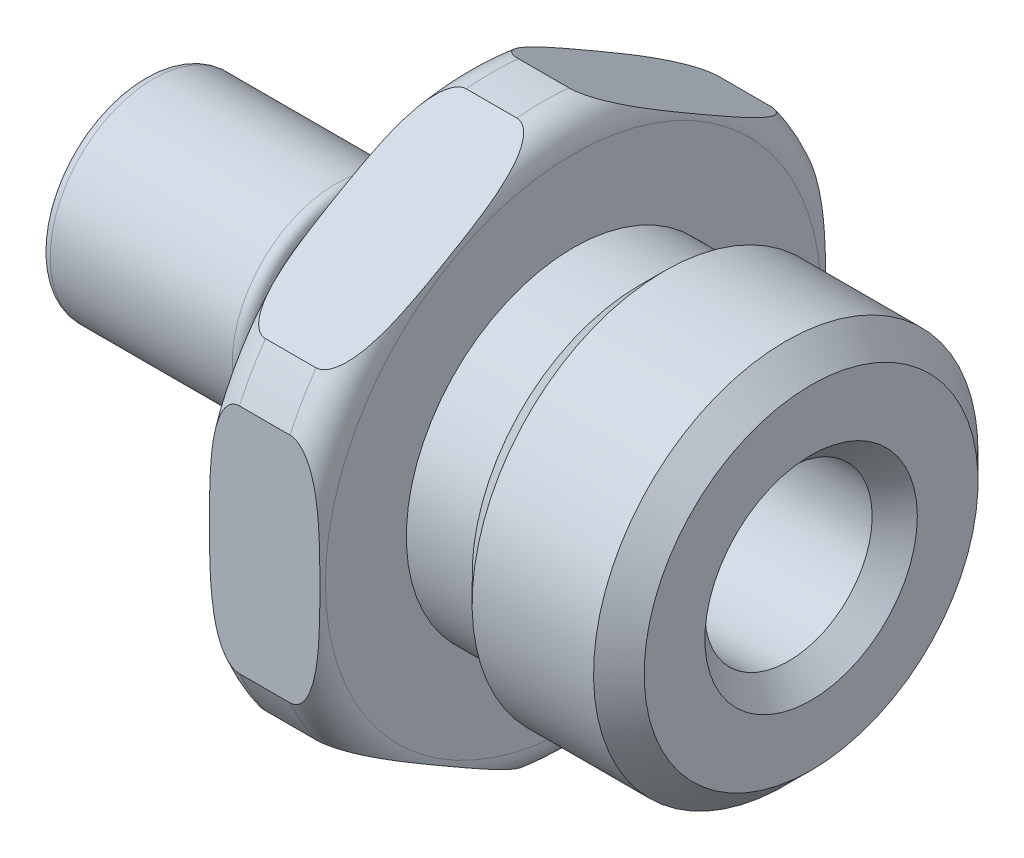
ISO-10303-21;
HEADER;
FILE_DESCRIPTION(('STEP AP214'),'2;1');
FILE_NAME('part.step','',(''),(''),'','','');
FILE_SCHEMA(('AUTOMOTIVE_DESIGN { 1 0 10303 214 1 1 1 1 }'));
ENDSEC;
DATA;
#1=APPLICATION_CONTEXT('core data for automotive mechanical design processes');
#2=APPLICATION_PROTOCOL_DEFINITION('international standard','automotive_design',2000,#1);
#3=PRODUCT_CONTEXT('',#1,'mechanical');
#4=PRODUCT('Part','Part','',(#3));
#5=PRODUCT_RELATED_PRODUCT_CATEGORY('part','',(#4));
#6=PRODUCT_DEFINITION_FORMATION('','',#4);
#7=PRODUCT_DEFINITION_CONTEXT('part definition',#1,'design');
#8=PRODUCT_DEFINITION('design','',#6,#7);
#9=PRODUCT_DEFINITION_SHAPE('','',#8);
#10=(LENGTH_UNIT() NAMED_UNIT(*) SI_UNIT(.MILLI.,.METRE.));
#11=(NAMED_UNIT(*) PLANE_ANGLE_UNIT() SI_UNIT($,.RADIAN.));
#12=(NAMED_UNIT(*) SI_UNIT($,.STERADIAN.) SOLID_ANGLE_UNIT());
#13=UNCERTAINTY_MEASURE_WITH_UNIT(LENGTH_MEASURE(1.E-05),#10,'distance_accuracy_value','');
#14=(GEOMETRIC_REPRESENTATION_CONTEXT(3) GLOBAL_UNCERTAINTY_ASSIGNED_CONTEXT((#13)) GLOBAL_UNIT_ASSIGNED_CONTEXT((#10,
#11,#12)) REPRESENTATION_CONTEXT('',''));
#15=CARTESIAN_POINT('',(0.,0.,0.));
#16=DIRECTION('',(0.,0.,1.));
#17=DIRECTION('',(1.,0.,0.));
#18=AXIS2_PLACEMENT_3D('',#15,#16,#17);
#19=CARTESIAN_POINT('',(-6.731,0.,0.));
#20=DIRECTION('',(1.,0.,0.));
#21=DIRECTION('',(0.,1.,0.));
#22=AXIS2_PLACEMENT_3D('',#19,#20,#21);
#23=TOROIDAL_SURFACE('',#22,6.223,0.762);
#24=CARTESIAN_POINT('',(-5.969,0.,0.));
#25=DIRECTION('',(1.,0.,0.));
#26=DIRECTION('',(0.,1.,0.));
#27=AXIS2_PLACEMENT_3D('',#24,#25,#26);
#28=CIRCLE('',#27,6.223);
#29=CARTESIAN_POINT('',(-5.969,6.22299999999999,0.));
#30=VERTEX_POINT('',#29);
#31=EDGE_CURVE('E461',#30,#30,#28,.T.);
#32=ORIENTED_EDGE('',*,*,#31,.F.);
#33=EDGE_LOOP('',(#32));
#34=FACE_BOUND('',#33,.T.);
#35=CARTESIAN_POINT('',(-6.731,0.,0.));
#36=DIRECTION('',(1.,0.,0.));
#37=DIRECTION('',(0.,1.,0.));
#38=AXIS2_PLACEMENT_3D('',#35,#36,#37);
#39=CIRCLE('',#38,6.985);
#40=CARTESIAN_POINT('',(-6.73100000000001,2.90993556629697,-6.35));
#41=VERTEX_POINT('',#40);
#42=CARTESIAN_POINT('',(-6.73100000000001,4.0442935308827,-5.69507812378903));
#43=VERTEX_POINT('',#42);
#44=EDGE_CURVE('E181',#41,#43,#39,.T.);
#45=ORIENTED_EDGE('',*,*,#44,.T.);
#46=CARTESIAN_POINT('',(-6.7312,4.04429356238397,-5.69507806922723));
#47=CARTESIAN_POINT('',(-6.71172429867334,4.04426273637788,-5.69513146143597));
#48=CARTESIAN_POINT('',(-6.69231007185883,4.04517612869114,-5.69354941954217));
#49=CARTESIAN_POINT('',(-6.65430190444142,4.0486650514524,-5.68750642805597));
#50=CARTESIAN_POINT('',(-6.63570125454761,4.05122203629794,-5.68307760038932));
#51=CARTESIAN_POINT('',(-6.59558098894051,4.0585033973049,-5.67046591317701));
#52=CARTESIAN_POINT('',(-6.57432188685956,4.06358131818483,-5.66167069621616));
#53=CARTESIAN_POINT('',(-6.53367154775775,4.07539867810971,-5.64120242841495));
#54=CARTESIAN_POINT('',(-6.51428925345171,4.08214557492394,-5.62951646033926));
#55=CARTESIAN_POINT('',(-6.4673674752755,4.10089492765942,-5.59704162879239));
#56=CARTESIAN_POINT('',(-6.44120058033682,4.11374767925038,-5.57478001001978));
#57=CARTESIAN_POINT('',(-6.39298061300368,4.14122591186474,-5.52718631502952));
#58=CARTESIAN_POINT('',(-6.37093531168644,4.15585465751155,-5.50184858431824));
#59=CARTESIAN_POINT('',(-6.33087637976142,4.18576020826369,-5.4500506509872));
#60=CARTESIAN_POINT('',(-6.31275890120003,4.20100283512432,-5.42364964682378));
#61=CARTESIAN_POINT('',(-6.27914689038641,4.23220284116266,-5.36960965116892));
#62=CARTESIAN_POINT('',(-6.26365500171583,4.24816092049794,-5.341969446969));
#63=CARTESIAN_POINT('',(-6.23483474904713,4.28059793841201,-5.2857868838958));
#64=CARTESIAN_POINT('',(-6.22151160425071,4.29707802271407,-5.25724254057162));
#65=CARTESIAN_POINT('',(-6.1967332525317,4.33037040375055,-5.1995784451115));
#66=CARTESIAN_POINT('',(-6.18527697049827,4.34718250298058,-5.17045903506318));
#67=CARTESIAN_POINT('',(-6.15255610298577,4.39910341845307,-5.08052937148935));
#68=CARTESIAN_POINT('',(-6.13385144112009,4.4346154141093,-5.01902079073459));
#69=CARTESIAN_POINT('',(-6.10132974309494,4.50620403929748,-4.89502565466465));
#70=CARTESIAN_POINT('',(-6.08751769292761,4.54228120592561,-4.83253816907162));
#71=CARTESIAN_POINT('',(-6.06355074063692,4.61484750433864,-4.70684965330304));
#72=CARTESIAN_POINT('',(-6.0534073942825,4.65133757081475,-4.64364700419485));
#73=CARTESIAN_POINT('',(-6.0359363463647,4.72448896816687,-4.51694506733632));
#74=CARTESIAN_POINT('',(-6.02860933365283,4.76115033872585,-4.45344571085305));
#75=CARTESIAN_POINT('',(-6.01605083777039,4.83479325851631,-4.32589243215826));
#76=CARTESIAN_POINT('',(-6.01083288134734,4.87177536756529,-4.26183754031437));
#77=CARTESIAN_POINT('',(-6.00202464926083,4.94578901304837,-4.13364214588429));
#78=CARTESIAN_POINT('',(-5.99843450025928,4.98282055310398,-4.06950163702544));
#79=CARTESIAN_POINT('',(-5.98945443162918,5.09381559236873,-3.8772525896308));
#80=CARTESIAN_POINT('',(-5.98583542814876,5.16781365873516,-3.74908417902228));
#81=CARTESIAN_POINT('',(-5.98197816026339,5.28896776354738,-3.53923911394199));
#82=CARTESIAN_POINT('',(-5.98098966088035,5.3361204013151,-3.45756834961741));
#83=CARTESIAN_POINT('',(-5.97978259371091,5.4304289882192,-3.29422108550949));
#84=CARTESIAN_POINT('',(-5.97956403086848,5.4775849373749,-3.21254458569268));
#85=CARTESIAN_POINT('',(-5.97982047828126,5.57174728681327,-3.04945061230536));
#86=CARTESIAN_POINT('',(-5.98029330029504,5.61875368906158,-2.96803313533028));
#87=CARTESIAN_POINT('',(-5.98207639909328,5.71275839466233,-2.80521220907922));
#88=CARTESIAN_POINT('',(-5.98338659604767,5.75975669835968,-2.72380875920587));
#89=CARTESIAN_POINT('',(-5.98786724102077,5.87048244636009,-2.53202613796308));
#90=CARTESIAN_POINT('',(-5.99153409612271,5.93420535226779,-2.42165482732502));
#91=CARTESIAN_POINT('',(-6.00255999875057,6.06159002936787,-2.20101809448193));
#92=CARTESIAN_POINT('',(-6.00991934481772,6.12525179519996,-2.09075268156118));
#93=CARTESIAN_POINT('',(-6.02754570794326,6.23250017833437,-1.90499303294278));
#94=CARTESIAN_POINT('',(-6.03618848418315,6.27615142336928,-1.82938685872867));
#95=CARTESIAN_POINT('',(-6.05756697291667,6.36328687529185,-1.67846382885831));
#96=CARTESIAN_POINT('',(-6.07030895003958,6.4067707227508,-1.60314759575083));
#97=CARTESIAN_POINT('',(-6.09462093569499,6.47415439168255,-1.48643565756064));
#98=CARTESIAN_POINT('',(-6.10422781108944,6.49823044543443,-1.44473470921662));
#99=CARTESIAN_POINT('',(-6.12561305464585,6.54613814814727,-1.36175613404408));
#100=CARTESIAN_POINT('',(-6.13739087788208,6.56996985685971,-1.32047840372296));
#101=CARTESIAN_POINT('',(-6.16356718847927,6.61720405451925,-1.23866637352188));
#102=CARTESIAN_POINT('',(-6.17795828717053,6.6406075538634,-1.1981303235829));
#103=CARTESIAN_POINT('',(-6.2100085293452,6.68684086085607,-1.11805188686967));
#104=CARTESIAN_POINT('',(-6.22766492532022,6.70967113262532,-1.07850869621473));
#105=CARTESIAN_POINT('',(-6.2620747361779,6.74870547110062,-1.01089923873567));
#106=CARTESIAN_POINT('',(-6.27790495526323,6.76511136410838,-0.98248339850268));
#107=CARTESIAN_POINT('',(-6.3123711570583,6.79721296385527,-0.926881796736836));
#108=CARTESIAN_POINT('',(-6.33101100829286,6.81290765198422,-0.899697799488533));
#109=CARTESIAN_POINT('',(-6.37186243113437,6.84331315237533,-0.847033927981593));
#110=CARTESIAN_POINT('',(-6.3941045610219,6.85801386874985,-0.821571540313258));
#111=CARTESIAN_POINT('',(-6.44277514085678,6.88559144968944,-0.773805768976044));
#112=CARTESIAN_POINT('',(-6.46919314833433,6.89847271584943,-0.751494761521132));
#113=CARTESIAN_POINT('',(-6.51482314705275,6.91651620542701,-0.720242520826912));
#114=CARTESIAN_POINT('',(-6.5324694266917,6.92266206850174,-0.709597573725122));
#115=CARTESIAN_POINT('',(-6.56932943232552,6.93358456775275,-0.690679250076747));
#116=CARTESIAN_POINT('',(-6.58853713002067,6.93836617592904,-0.682397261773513));
#117=CARTESIAN_POINT('',(-6.6278291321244,6.94609578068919,-0.669009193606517));
#118=CARTESIAN_POINT('',(-6.64787721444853,6.94908859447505,-0.66382548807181));
#119=CARTESIAN_POINT('',(-6.68898214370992,6.95318743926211,-0.65672608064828));
#120=CARTESIAN_POINT('',(-6.71004855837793,6.95426906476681,-0.654852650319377));
#121=CARTESIAN_POINT('',(-6.73120000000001,6.95422906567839,-0.654921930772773));
#122=B_SPLINE_CURVE_WITH_KNOTS('',3,(#46,#47,#48,#49,#50,#51,#52,#53,#54,#55,#56,#57,#58,#59,
#60,#61,#62,#63,#64,#65,#66,#67,#68,#69,#70,#71,#72,#73,#74,#75,#76,#77,#78,#79,#80,#81,#82,#83,
#84,#85,#86,#87,#88,#89,#90,#91,#92,#93,#94,#95,#96,#97,#98,#99,#100,#101,#102,#103,#104,#105,
#106,#107,#108,#109,#110,#111,#112,#113,#114,#115,#116,#117,#118,#119,#120,#121),.UNSPECIFIED.,
.F.,.F.,(4,2,2,2,2,2,2,2,2,2,2,2,2,2,2,2,2,2,2,2,2,2,2,2,2,2,2,2,2,2,2,2,2,2,2,2,2,4),(0.,
0.0582392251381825,0.115832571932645,0.186122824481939,0.256733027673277,0.366156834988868,
0.47578491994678,0.582012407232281,0.688346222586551,0.794932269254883,0.901456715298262,
1.12151552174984,1.34179794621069,1.56276830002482,1.78379266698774,2.00621293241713,
2.22865050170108,2.67271909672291,2.95565019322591,3.23858310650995,3.52062246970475,
3.80263494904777,4.18510678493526,4.56760954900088,4.83073782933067,5.09427016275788,
5.2415350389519,5.38876300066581,5.53558099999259,5.68227602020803,5.79146710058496,
5.90080992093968,6.01113421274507,6.12118686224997,6.18552009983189,6.2496157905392,
6.31202979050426,6.37523519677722),.UNSPECIFIED.);
#123=CARTESIAN_POINT('',(-6.73100000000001,6.95422909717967,-0.654921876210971));
#124=VERTEX_POINT('',#123);
#125=EDGE_CURVE('E235',#43,#124,#122,.T.);
#126=ORIENTED_EDGE('',*,*,#125,.T.);
#127=CARTESIAN_POINT('',(-6.73100000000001,6.95422909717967,0.654921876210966));
#128=VERTEX_POINT('',#127);
#129=EDGE_CURVE('E170',#124,#128,#39,.T.);
#130=ORIENTED_EDGE('',*,*,#129,.T.);
#131=CARTESIAN_POINT('',(-6.7312,6.95422906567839,0.654921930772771));
#132=CARTESIAN_POINT('',(-6.71172429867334,6.95425989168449,0.654868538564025));
#133=CARTESIAN_POINT('',(-6.69231007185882,6.95334649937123,0.656450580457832));
#134=CARTESIAN_POINT('',(-6.65430190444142,6.94985757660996,0.66249357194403));
#135=CARTESIAN_POINT('',(-6.63570125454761,6.94730059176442,0.666922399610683));
#136=CARTESIAN_POINT('',(-6.5955809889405,6.94001923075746,0.679534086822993));
#137=CARTESIAN_POINT('',(-6.57432188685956,6.93494130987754,0.68832930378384));
#138=CARTESIAN_POINT('',(-6.53367154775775,6.92312394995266,0.708797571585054));
#139=CARTESIAN_POINT('',(-6.5142892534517,6.91637705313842,0.720483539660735));
#140=CARTESIAN_POINT('',(-6.4673674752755,6.89762770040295,0.752958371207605));
#141=CARTESIAN_POINT('',(-6.44120058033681,6.88477494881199,0.775219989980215));
#142=CARTESIAN_POINT('',(-6.39298061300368,6.85729671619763,0.822813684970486));
#143=CARTESIAN_POINT('',(-6.37093531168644,6.84266797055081,0.848151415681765));
#144=CARTESIAN_POINT('',(-6.33087637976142,6.81276241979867,0.899949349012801));
#145=CARTESIAN_POINT('',(-6.31275890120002,6.79751979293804,0.926350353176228));
#146=CARTESIAN_POINT('',(-6.2791468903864,6.76631978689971,0.980390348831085));
#147=CARTESIAN_POINT('',(-6.26365500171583,6.75036170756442,1.00803055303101));
#148=CARTESIAN_POINT('',(-6.23483474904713,6.71792468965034,1.06421311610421));
#149=CARTESIAN_POINT('',(-6.22151160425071,6.70144460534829,1.09275745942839));
#150=CARTESIAN_POINT('',(-6.1967332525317,6.66815222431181,1.15042155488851));
#151=CARTESIAN_POINT('',(-6.18527697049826,6.65134012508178,1.17954096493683));
#152=CARTESIAN_POINT('',(-6.15255610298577,6.59941920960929,1.26947062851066));
#153=CARTESIAN_POINT('',(-6.13385144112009,6.56390721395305,1.33097920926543));
#154=CARTESIAN_POINT('',(-6.10132974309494,6.49231858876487,1.45497434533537));
#155=CARTESIAN_POINT('',(-6.08751769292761,6.45624142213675,1.51746183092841));
#156=CARTESIAN_POINT('',(-6.06355074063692,6.38367512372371,1.64315034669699));
#157=CARTESIAN_POINT('',(-6.05340739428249,6.3471850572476,1.70635299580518));
#158=CARTESIAN_POINT('',(-6.03593634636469,6.27403365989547,1.83305493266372));
#159=CARTESIAN_POINT('',(-6.02860933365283,6.23737228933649,1.89655428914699));
#160=CARTESIAN_POINT('',(-6.01605083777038,6.16372936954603,2.02410756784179));
#161=CARTESIAN_POINT('',(-6.01083288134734,6.12674726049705,2.08816245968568));
#162=CARTESIAN_POINT('',(-6.00202464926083,6.05273361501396,2.21635785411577));
#163=CARTESIAN_POINT('',(-5.99843450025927,6.01570207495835,2.28049836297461));
#164=CARTESIAN_POINT('',(-5.98945443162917,5.9047070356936,2.47274741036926));
#165=CARTESIAN_POINT('',(-5.98583542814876,5.83070896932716,2.60091582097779));
#166=CARTESIAN_POINT('',(-5.98197816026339,5.70955486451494,2.81076088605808));
#167=CARTESIAN_POINT('',(-5.98098966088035,5.66240222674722,2.89243165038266));
#168=CARTESIAN_POINT('',(-5.97978259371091,5.56809363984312,3.05577891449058));
#169=CARTESIAN_POINT('',(-5.97956403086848,5.52093769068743,3.13745541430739));
#170=CARTESIAN_POINT('',(-5.97982047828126,5.42677534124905,3.3005493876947));
#171=CARTESIAN_POINT('',(-5.98029330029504,5.37976893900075,3.38196686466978));
#172=CARTESIAN_POINT('',(-5.98207639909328,5.2857642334,3.54478779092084));
#173=CARTESIAN_POINT('',(-5.98338659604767,5.23876592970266,3.62619124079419));
#174=CARTESIAN_POINT('',(-5.98786724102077,5.12804018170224,3.81797386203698));
#175=CARTESIAN_POINT('',(-5.99153409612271,5.06431727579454,3.92834517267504));
#176=CARTESIAN_POINT('',(-6.00255999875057,4.93693259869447,4.14898190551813));
#177=CARTESIAN_POINT('',(-6.00991934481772,4.87327083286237,4.25924731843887));
#178=CARTESIAN_POINT('',(-6.02754570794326,4.76602244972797,4.44500696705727));
#179=CARTESIAN_POINT('',(-6.03618848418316,4.72237120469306,4.52061314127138));
#180=CARTESIAN_POINT('',(-6.05756697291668,4.63523575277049,4.67153617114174));
#181=CARTESIAN_POINT('',(-6.07030895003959,4.59175190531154,4.74685240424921));
#182=CARTESIAN_POINT('',(-6.094620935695,4.52436823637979,4.8635643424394));
#183=CARTESIAN_POINT('',(-6.10422781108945,4.50029218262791,4.90526529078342));
#184=CARTESIAN_POINT('',(-6.12561305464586,4.45238447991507,4.98824386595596));
#185=CARTESIAN_POINT('',(-6.13739087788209,4.42855277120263,5.02952159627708));
#186=CARTESIAN_POINT('',(-6.16356718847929,4.38131857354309,5.11133362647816));
#187=CARTESIAN_POINT('',(-6.17795828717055,4.35791507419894,5.15186967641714));
#188=CARTESIAN_POINT('',(-6.21000852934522,4.31168176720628,5.23194811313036));
#189=CARTESIAN_POINT('',(-6.22766492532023,4.28885149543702,5.27149130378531));
#190=CARTESIAN_POINT('',(-6.26207473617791,4.24981715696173,5.33910076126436));
#191=CARTESIAN_POINT('',(-6.27790495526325,4.23341126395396,5.36751660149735));
#192=CARTESIAN_POINT('',(-6.31237115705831,4.20130966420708,5.42311820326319));
#193=CARTESIAN_POINT('',(-6.33101100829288,4.18561497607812,5.45030220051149));
#194=CARTESIAN_POINT('',(-6.37186243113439,4.15520947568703,5.50296607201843));
#195=CARTESIAN_POINT('',(-6.39410456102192,4.14050875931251,5.52842845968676));
#196=CARTESIAN_POINT('',(-6.4427751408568,4.11293117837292,5.57619423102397));
#197=CARTESIAN_POINT('',(-6.46919314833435,4.10004991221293,5.59850523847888));
#198=CARTESIAN_POINT('',(-6.51482314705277,4.08200642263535,5.6297574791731));
#199=CARTESIAN_POINT('',(-6.53246942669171,4.07586055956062,5.64040242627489));
#200=CARTESIAN_POINT('',(-6.56932943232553,4.06493806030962,5.65932074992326));
#201=CARTESIAN_POINT('',(-6.58853713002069,4.06015645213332,5.66760273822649));
#202=CARTESIAN_POINT('',(-6.62782913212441,4.05242684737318,5.68099080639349));
#203=CARTESIAN_POINT('',(-6.64787721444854,4.04943403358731,5.68617451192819));
#204=CARTESIAN_POINT('',(-6.68898214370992,4.04533518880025,5.69327391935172));
#205=CARTESIAN_POINT('',(-6.71004855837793,4.04425356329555,5.69514734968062));
#206=CARTESIAN_POINT('',(-6.7312,4.04429356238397,5.69507806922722));
#207=B_SPLINE_CURVE_WITH_KNOTS('',3,(#131,#132,#133,#134,#135,#136,#137,#138,#139,#140,#141,
#142,#143,#144,#145,#146,#147,#148,#149,#150,#151,#152,#153,#154,#155,#156,#157,#158,#159,#160,
#161,#162,#163,#164,#165,#166,#167,#168,#169,#170,#171,#172,#173,#174,#175,#176,#177,#178,#179,
#180,#181,#182,#183,#184,#185,#186,#187,#188,#189,#190,#191,#192,#193,#194,#195,#196,#197,#198,
#199,#200,#201,#202,#203,#204,#205,#206),.UNSPECIFIED.,.F.,.F.,(4,2,2,2,2,2,2,2,2,2,2,2,2,2,2,2,
2,2,2,2,2,2,2,2,2,2,2,2,2,2,2,2,2,2,2,2,2,4),(0.,0.0582392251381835,0.115832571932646,
0.18612282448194,0.256733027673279,0.366156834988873,0.475784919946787,0.582012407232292,
0.688346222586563,0.794932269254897,0.901456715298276,1.12151552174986,1.34179794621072,
1.56276830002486,1.78379266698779,2.00621293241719,2.22865050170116,2.672719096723,
2.955650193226,3.23858310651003,3.52062246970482,3.80263494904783,4.18510678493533,
4.56760954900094,4.83073782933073,5.09427016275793,5.24153503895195,5.38876300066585,
5.53558099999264,5.68227602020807,5.791467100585,5.90080992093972,6.0111342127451,
6.12118686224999,6.18552009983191,6.24961579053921,6.31202979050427,6.37523519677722),.UNSPECIFIED.);
#208=CARTESIAN_POINT('',(-6.73100000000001,4.0442935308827,5.69507812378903));
#209=VERTEX_POINT('',#208);
#210=EDGE_CURVE('E164',#128,#209,#207,.T.);
#211=ORIENTED_EDGE('',*,*,#210,.T.);
#212=CARTESIAN_POINT('',(-6.73100000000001,2.90993556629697,6.35));
#213=VERTEX_POINT('',#212);
#214=EDGE_CURVE('E162',#209,#213,#39,.T.);
#215=ORIENTED_EDGE('',*,*,#214,.T.);
#216=CARTESIAN_POINT('',(-5.97965786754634,0.,6.35));
#217=CARTESIAN_POINT('',(-5.9796616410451,-0.127074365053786,6.35));
#218=CARTESIAN_POINT('',(-5.98027460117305,-0.254148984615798,6.35));
#219=CARTESIAN_POINT('',(-5.98308594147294,-0.50832399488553,6.35));
#220=CARTESIAN_POINT('',(-5.98528481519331,-0.63542438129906,6.35));
#221=CARTESIAN_POINT('',(-5.99233451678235,-0.889632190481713,6.35));
#222=CARTESIAN_POINT('',(-5.997186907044,-1.01673957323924,6.35));
#223=CARTESIAN_POINT('',(-6.01137288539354,-1.27068883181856,6.35));
#224=CARTESIAN_POINT('',(-6.02070447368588,-1.39753080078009,6.35));
#225=CARTESIAN_POINT('',(-6.04026737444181,-1.58761085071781,6.35));
#226=CARTESIAN_POINT('',(-6.04774628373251,-1.65112739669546,6.35));
#227=CARTESIAN_POINT('',(-6.06509336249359,-1.77782876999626,6.35));
#228=CARTESIAN_POINT('',(-6.07496104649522,-1.84101366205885,6.35));
#229=CARTESIAN_POINT('',(-6.0977039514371,-1.96666194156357,6.35));
#230=CARTESIAN_POINT('',(-6.11057042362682,-2.02912688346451,6.35));
#231=CARTESIAN_POINT('',(-6.14018107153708,-2.15311598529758,6.35));
#232=CARTESIAN_POINT('',(-6.15692247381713,-2.21464078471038,6.35));
#233=CARTESIAN_POINT('',(-6.19008855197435,-2.31905730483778,6.35));
#234=CARTESIAN_POINT('',(-6.20528525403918,-2.36233552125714,6.35));
#235=CARTESIAN_POINT('',(-6.23898274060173,-2.44770362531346,6.35));
#236=CARTESIAN_POINT('',(-6.25748928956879,-2.48979128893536,6.35));
#237=CARTESIAN_POINT('',(-6.29879686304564,-2.57227019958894,6.35));
#238=CARTESIAN_POINT('',(-6.3216318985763,-2.6126446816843,6.35));
#239=CARTESIAN_POINT('',(-6.3726491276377,-2.6898570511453,6.35));
#240=CARTESIAN_POINT('',(-6.40081263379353,-2.7267066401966,6.35));
#241=CARTESIAN_POINT('',(-6.44857532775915,-2.77772723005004,6.35));
#242=CARTESIAN_POINT('',(-6.46568443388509,-2.79421613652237,6.35));
#243=CARTESIAN_POINT('',(-6.50189164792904,-2.82490931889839,6.35));
#244=CARTESIAN_POINT('',(-6.5209905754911,-2.83911264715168,6.35));
#245=CARTESIAN_POINT('',(-6.56147207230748,-2.86453759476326,6.35));
#246=CARTESIAN_POINT('',(-6.58288102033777,-2.87571820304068,6.35));
#247=CARTESIAN_POINT('',(-6.62745084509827,-2.89374772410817,6.35));
#248=CARTESIAN_POINT('',(-6.65060741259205,-2.90060692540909,6.35));
#249=CARTESIAN_POINT('',(-6.69527217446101,-2.90862705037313,6.35));
#250=CARTESIAN_POINT('',(-6.71668114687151,-2.91033221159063,6.35));
#251=CARTESIAN_POINT('',(-6.75940337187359,-2.90938269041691,6.35));
#252=CARTESIAN_POINT('',(-6.78071662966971,-2.90672824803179,6.35));
#253=CARTESIAN_POINT('',(-6.8191790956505,-2.89812883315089,6.35));
#254=CARTESIAN_POINT('',(-6.83646208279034,-2.89275698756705,6.35));
#255=CARTESIAN_POINT('',(-6.87005166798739,-2.8795622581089,6.35));
#256=CARTESIAN_POINT('',(-6.88635809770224,-2.87173895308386,6.35));
#257=CARTESIAN_POINT('',(-6.92684962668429,-2.84903945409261,6.35));
#258=CARTESIAN_POINT('',(-6.95020568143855,-2.83268874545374,6.35));
#259=CARTESIAN_POINT('',(-6.99410256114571,-2.79655883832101,6.35));
#260=CARTESIAN_POINT('',(-7.01463436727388,-2.77676909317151,6.35));
#261=CARTESIAN_POINT('',(-7.06720744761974,-2.71958080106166,6.35));
#262=CARTESIAN_POINT('',(-7.09671119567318,-2.67987258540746,6.35));
#263=CARTESIAN_POINT('',(-7.1498001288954,-2.59678410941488,6.35));
#264=CARTESIAN_POINT('',(-7.17337437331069,-2.5533972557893,6.35));
#265=CARTESIAN_POINT('',(-7.22343888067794,-2.44893644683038,6.35));
#266=CARTESIAN_POINT('',(-7.2480669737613,-2.38698216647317,6.35));
#267=CARTESIAN_POINT('',(-7.29137772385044,-2.26098716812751,6.35));
#268=CARTESIAN_POINT('',(-7.3100480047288,-2.19694240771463,6.35));
#269=CARTESIAN_POINT('',(-7.34300411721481,-2.06727486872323,6.35));
#270=CARTESIAN_POINT('',(-7.3572579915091,-2.00164413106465,6.35));
#271=CARTESIAN_POINT('',(-7.38225740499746,-1.86982075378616,6.35));
#272=CARTESIAN_POINT('',(-7.39300721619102,-1.80362890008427,6.35));
#273=CARTESIAN_POINT('',(-7.41256689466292,-1.6655286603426,6.35));
#274=CARTESIAN_POINT('',(-7.4211509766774,-1.59358897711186,6.35));
#275=CARTESIAN_POINT('',(-7.43591622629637,-1.44945901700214,6.35));
#276=CARTESIAN_POINT('',(-7.44209696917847,-1.37726869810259,6.35));
#277=CARTESIAN_POINT('',(-7.45793911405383,-1.16040209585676,6.35));
#278=CARTESIAN_POINT('',(-7.46488766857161,-1.01553354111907,6.35));
#279=CARTESIAN_POINT('',(-7.47482885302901,-0.725131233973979,6.35));
#280=CARTESIAN_POINT('',(-7.47780596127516,-0.579597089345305,6.35));
#281=CARTESIAN_POINT('',(-7.48156661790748,-0.288574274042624,6.35));
#282=CARTESIAN_POINT('',(-7.48235124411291,-0.143085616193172,6.35));
#283=CARTESIAN_POINT('',(-7.48233283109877,0.148462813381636,6.35));
#284=CARTESIAN_POINT('',(-7.48152354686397,0.294522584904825,6.35));
#285=CARTESIAN_POINT('',(-7.47767903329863,0.586688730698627,6.35));
#286=CARTESIAN_POINT('',(-7.47464268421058,0.732795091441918,6.35));
#287=CARTESIAN_POINT('',(-7.46450652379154,1.02430396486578,6.35));
#288=CARTESIAN_POINT('',(-7.45742342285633,1.16970690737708,6.35));
#289=CARTESIAN_POINT('',(-7.44127034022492,1.38735944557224,6.35));
#290=CARTESIAN_POINT('',(-7.43496797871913,1.45980784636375,6.35));
#291=CARTESIAN_POINT('',(-7.41990877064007,1.60444437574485,6.35));
#292=CARTESIAN_POINT('',(-7.41115232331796,1.67663254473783,6.35));
#293=CARTESIAN_POINT('',(-7.39030892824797,1.82135941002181,6.35));
#294=CARTESIAN_POINT('',(-7.37818614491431,1.89389312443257,6.35));
#295=CARTESIAN_POINT('',(-7.34955786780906,2.03825786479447,6.35));
#296=CARTESIAN_POINT('',(-7.33304376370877,2.110087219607,6.35));
#297=CARTESIAN_POINT('',(-7.29441906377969,2.25116022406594,6.35));
#298=CARTESIAN_POINT('',(-7.2723958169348,2.32042647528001,6.35));
#299=CARTESIAN_POINT('',(-7.23346189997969,2.42196612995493,6.35));
#300=CARTESIAN_POINT('',(-7.21952352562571,2.45537588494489,6.35));
#301=CARTESIAN_POINT('',(-7.18928252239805,2.52109797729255,6.35));
#302=CARTESIAN_POINT('',(-7.17298155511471,2.55341106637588,6.35));
#303=CARTESIAN_POINT('',(-7.13821979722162,2.61520784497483,6.35));
#304=CARTESIAN_POINT('',(-7.11986938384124,2.64475284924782,6.35));
#305=CARTESIAN_POINT('',(-7.07994010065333,2.70169704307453,6.35));
#306=CARTESIAN_POINT('',(-7.05835684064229,2.72909323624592,6.35));
#307=CARTESIAN_POINT('',(-7.01559693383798,2.77581190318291,6.35));
#308=CARTESIAN_POINT('',(-6.9950466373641,2.79569995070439,6.35));
#309=CARTESIAN_POINT('',(-6.9510926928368,2.83203674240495,6.35));
#310=CARTESIAN_POINT('',(-6.92769636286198,2.84849402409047,6.35));
#311=CARTESIAN_POINT('',(-6.88560916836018,2.87220617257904,6.35));
#312=CARTESIAN_POINT('',(-6.86764343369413,2.88073820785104,6.35));
#313=CARTESIAN_POINT('',(-6.83056308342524,2.89478684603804,6.35));
#314=CARTESIAN_POINT('',(-6.81144968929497,2.9003065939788,6.35));
#315=CARTESIAN_POINT('',(-6.77238504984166,2.90784616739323,6.35));
#316=CARTESIAN_POINT('',(-6.75242876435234,2.90984051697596,6.35));
#317=CARTESIAN_POINT('',(-6.71249808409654,2.91002387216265,6.35));
#318=CARTESIAN_POINT('',(-6.69252369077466,2.90821315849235,6.35));
#319=CARTESIAN_POINT('',(-6.65516602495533,2.90134807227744,6.35));
#320=CARTESIAN_POINT('',(-6.63771952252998,2.89662584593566,6.35));
#321=CARTESIAN_POINT('',(-6.60373612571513,2.88463122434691,6.35));
#322=CARTESIAN_POINT('',(-6.58719964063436,2.87735769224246,6.35));
#323=CARTESIAN_POINT('',(-6.5470675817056,2.85645472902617,6.35));
#324=CARTESIAN_POINT('',(-6.52417700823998,2.8414760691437,6.35));
#325=CARTESIAN_POINT('',(-6.48102058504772,2.80812634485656,6.35));
#326=CARTESIAN_POINT('',(-6.46076207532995,2.78974612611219,6.35));
#327=CARTESIAN_POINT('',(-6.40942105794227,2.73706935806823,6.35));
#328=CARTESIAN_POINT('',(-6.38060109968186,2.70058898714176,6.35));
#329=CARTESIAN_POINT('',(-6.32845679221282,2.62395270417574,6.35));
#330=CARTESIAN_POINT('',(-6.30514624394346,2.58378790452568,6.35));
#331=CARTESIAN_POINT('',(-6.25638264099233,2.48876418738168,6.35));
#332=CARTESIAN_POINT('',(-6.23242829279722,2.43314670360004,6.35));
#333=CARTESIAN_POINT('',(-6.18987727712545,2.31986191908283,6.35));
#334=CARTESIAN_POINT('',(-6.17129107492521,2.26219085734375,6.35));
#335=CARTESIAN_POINT('',(-6.13816176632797,2.1454131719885,6.35));
#336=CARTESIAN_POINT('',(-6.12363903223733,2.08630087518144,6.35));
#337=CARTESIAN_POINT('',(-6.09784994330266,1.96744327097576,6.35));
#338=CARTESIAN_POINT('',(-6.08658069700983,1.90769857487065,6.35));
#339=CARTESIAN_POINT('',(-6.06390290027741,1.77164048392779,6.35));
#340=CARTESIAN_POINT('',(-6.05327450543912,1.69519901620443,6.35));
#341=CARTESIAN_POINT('',(-6.03508720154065,1.54194468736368,6.35));
#342=CARTESIAN_POINT('',(-6.02752918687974,1.46513172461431,6.35));
#343=CARTESIAN_POINT('',(-6.01470410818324,1.31122945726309,6.35));
#344=CARTESIAN_POINT('',(-6.00943975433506,1.23413993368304,6.35));
#345=CARTESIAN_POINT('',(-6.00062228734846,1.07986082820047,6.35));
#346=CARTESIAN_POINT('',(-5.99706931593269,1.00267123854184,6.35));
#347=CARTESIAN_POINT('',(-5.98826405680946,0.771249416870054,6.35));
#348=CARTESIAN_POINT('',(-5.98485047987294,0.616950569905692,6.35));
#349=CARTESIAN_POINT('',(-5.9805459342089,0.308434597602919,6.35));
#350=CARTESIAN_POINT('',(-5.97965328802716,0.154217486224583,6.35));
#351=CARTESIAN_POINT('',(-5.97965786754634,0.,6.35));
#352=B_SPLINE_CURVE_WITH_KNOTS('',3,(#216,#217,#218,#219,#220,#221,#222,#223,#224,#225,#226,
#227,#228,#229,#230,#231,#232,#233,#234,#235,#236,#237,#238,#239,#240,#241,#242,#243,#244,#245,
#246,#247,#248,#249,#250,#251,#252,#253,#254,#255,#256,#257,#258,#259,#260,#261,#262,#263,#264,
#265,#266,#267,#268,#269,#270,#271,#272,#273,#274,#275,#276,#277,#278,#279,#280,#281,#282,#283,
#284,#285,#286,#287,#288,#289,#290,#291,#292,#293,#294,#295,#296,#297,#298,#299,#300,#301,#302,
#303,#304,#305,#306,#307,#308,#309,#310,#311,#312,#313,#314,#315,#316,#317,#318,#319,#320,#321,
#322,#323,#324,#325,#326,#327,#328,#329,#330,#331,#332,#333,#334,#335,#336,#337,#338,#339,#340,
#341,#342,#343,#344,#345,#346,#347,#348,#349,#350,#351),.UNSPECIFIED.,.T.,.F.,(4,2,2,2,2,2,2,2,
2,2,2,2,2,2,2,2,2,2,2,2,2,2,2,2,2,2,2,2,2,2,2,2,2,2,2,2,2,2,2,2,2,2,2,2,2,2,2,2,2,2,2,2,2,2,2,2,
2,2,2,2,2,2,2,2,2,2,2,4),(0.,0.381222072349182,0.762562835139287,1.14412837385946,
1.52552371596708,1.71735605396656,1.90914943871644,2.10039013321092,2.29149437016,
2.42900233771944,2.56675216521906,2.70563294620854,2.84403539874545,2.91517254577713,
2.98633911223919,3.05842762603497,3.13034385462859,3.19434202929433,3.25833668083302,
3.31242271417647,3.36651804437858,3.45155811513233,3.53686373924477,3.68443340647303,
3.83227339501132,4.03180218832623,4.2317428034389,4.43309811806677,4.63420702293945,
4.85150291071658,5.06883718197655,5.50381776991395,5.94049346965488,6.37695446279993,
6.81512893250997,7.25352386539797,7.69012146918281,7.90825643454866,8.12635593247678,
8.34687257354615,8.56782482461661,8.78547418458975,8.89400628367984,9.00246242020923,
9.106646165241,9.21097269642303,9.29651700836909,9.38184583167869,9.44129398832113,
9.5006799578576,9.5604933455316,9.62030232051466,9.67430193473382,9.72832564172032,
9.80992343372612,9.89174410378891,10.0304294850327,10.1694586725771,10.3507037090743,
10.5322997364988,10.7147905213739,10.8971186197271,11.1285598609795,11.3600684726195,
11.5918498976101,11.8236505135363,12.2866098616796,12.7492610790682),.UNSPECIFIED.);
#353=CARTESIAN_POINT('',(-6.73100000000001,-2.90993556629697,6.35));
#354=VERTEX_POINT('',#353);
#355=EDGE_CURVE('E409',#213,#354,#352,.T.);
#356=ORIENTED_EDGE('',*,*,#355,.T.);
#357=CARTESIAN_POINT('',(-6.73100000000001,-4.0442935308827,5.69507812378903));
#358=VERTEX_POINT('',#357);
#359=EDGE_CURVE('E454',#354,#358,#39,.T.);
#360=ORIENTED_EDGE('',*,*,#359,.T.);
#361=CARTESIAN_POINT('',(-6.7312,-4.04429356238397,5.69507806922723));
#362=CARTESIAN_POINT('',(-6.71172429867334,-4.04426273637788,5.69513146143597));
#363=CARTESIAN_POINT('',(-6.69231007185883,-4.04517612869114,5.69354941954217));
#364=CARTESIAN_POINT('',(-6.65430190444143,-4.04866505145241,5.68750642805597));
#365=CARTESIAN_POINT('',(-6.63570125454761,-4.05122203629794,5.68307760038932));
#366=CARTESIAN_POINT('',(-6.59558098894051,-4.0585033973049,5.67046591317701));
#367=CARTESIAN_POINT('',(-6.57432188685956,-4.06358131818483,5.66167069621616));
#368=CARTESIAN_POINT('',(-6.53367154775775,-4.07539867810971,5.64120242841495));
#369=CARTESIAN_POINT('',(-6.51428925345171,-4.08214557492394,5.62951646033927));
#370=CARTESIAN_POINT('',(-6.4673674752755,-4.10089492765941,5.5970416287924));
#371=CARTESIAN_POINT('',(-6.44120058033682,-4.11374767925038,5.57478001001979));
#372=CARTESIAN_POINT('',(-6.39298061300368,-4.14122591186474,5.52718631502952));
#373=CARTESIAN_POINT('',(-6.37093531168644,-4.15585465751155,5.50184858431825));
#374=CARTESIAN_POINT('',(-6.33087637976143,-4.18576020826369,5.45005065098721));
#375=CARTESIAN_POINT('',(-6.31275890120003,-4.20100283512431,5.42364964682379));
#376=CARTESIAN_POINT('',(-6.27914689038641,-4.23220284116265,5.36960965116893));
#377=CARTESIAN_POINT('',(-6.26365500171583,-4.24816092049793,5.34196944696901));
#378=CARTESIAN_POINT('',(-6.23483474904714,-4.28059793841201,5.28578688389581));
#379=CARTESIAN_POINT('',(-6.22151160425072,-4.29707802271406,5.25724254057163));
#380=CARTESIAN_POINT('',(-6.19673325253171,-4.33037040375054,5.19957844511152));
#381=CARTESIAN_POINT('',(-6.18527697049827,-4.34718250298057,5.1704590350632));
#382=CARTESIAN_POINT('',(-6.15255610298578,-4.39910341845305,5.08052937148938));
#383=CARTESIAN_POINT('',(-6.1338514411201,-4.43461541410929,5.01902079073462));
#384=CARTESIAN_POINT('',(-6.10132974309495,-4.50620403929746,4.89502565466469));
#385=CARTESIAN_POINT('',(-6.08751769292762,-4.54228120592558,4.83253816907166));
#386=CARTESIAN_POINT('',(-6.06355074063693,-4.61484750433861,4.70684965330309));
#387=CARTESIAN_POINT('',(-6.0534073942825,-4.65133757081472,4.64364700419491));
#388=CARTESIAN_POINT('',(-6.0359363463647,-4.72448896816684,4.51694506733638));
#389=CARTESIAN_POINT('',(-6.02860933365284,-4.76115033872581,4.45344571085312));
#390=CARTESIAN_POINT('',(-6.01605083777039,-4.83479325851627,4.32589243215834));
#391=CARTESIAN_POINT('',(-6.01083288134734,-4.87177536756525,4.26183754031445));
#392=CARTESIAN_POINT('',(-6.00202464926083,-4.94578901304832,4.13364214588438));
#393=CARTESIAN_POINT('',(-5.99843450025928,-4.98282055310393,4.06950163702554));
#394=CARTESIAN_POINT('',(-5.98945443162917,-5.09381559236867,3.87725258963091));
#395=CARTESIAN_POINT('',(-5.98583542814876,-5.1678136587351,3.7490841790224));
#396=CARTESIAN_POINT('',(-5.98197816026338,-5.28896776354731,3.53923911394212));
#397=CARTESIAN_POINT('',(-5.98098966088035,-5.33612040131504,3.45756834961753));
#398=CARTESIAN_POINT('',(-5.9797825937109,-5.43042898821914,3.2942210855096));
#399=CARTESIAN_POINT('',(-5.97956403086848,-5.47758493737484,3.21254458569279));
#400=CARTESIAN_POINT('',(-5.97982047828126,-5.57174728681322,3.04945061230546));
#401=CARTESIAN_POINT('',(-5.98029330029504,-5.61875368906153,2.96803313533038));
#402=CARTESIAN_POINT('',(-5.98207639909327,-5.71275839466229,2.80521220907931));
#403=CARTESIAN_POINT('',(-5.98338659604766,-5.75975669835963,2.72380875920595));
#404=CARTESIAN_POINT('',(-5.98786724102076,-5.87048244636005,2.53202613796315));
#405=CARTESIAN_POINT('',(-5.9915340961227,-5.93420535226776,2.42165482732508));
#406=CARTESIAN_POINT('',(-6.00255999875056,-6.06159002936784,2.20101809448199));
#407=CARTESIAN_POINT('',(-6.00991934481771,-6.12525179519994,2.09075268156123));
#408=CARTESIAN_POINT('',(-6.02754570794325,-6.23250017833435,1.90499303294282));
#409=CARTESIAN_POINT('',(-6.03618848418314,-6.27615142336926,1.82938685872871));
#410=CARTESIAN_POINT('',(-6.05756697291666,-6.36328687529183,1.67846382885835));
#411=CARTESIAN_POINT('',(-6.07030895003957,-6.40677072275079,1.60314759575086));
#412=CARTESIAN_POINT('',(-6.09462093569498,-6.47415439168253,1.48643565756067));
#413=CARTESIAN_POINT('',(-6.10422781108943,-6.49823044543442,1.44473470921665));
#414=CARTESIAN_POINT('',(-6.12561305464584,-6.54613814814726,1.36175613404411));
#415=CARTESIAN_POINT('',(-6.13739087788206,-6.5699698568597,1.32047840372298));
#416=CARTESIAN_POINT('',(-6.16356718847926,-6.61720405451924,1.2386663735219));
#417=CARTESIAN_POINT('',(-6.17795828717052,-6.64060755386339,1.19813032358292));
#418=CARTESIAN_POINT('',(-6.21000852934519,-6.68684086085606,1.11805188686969));
#419=CARTESIAN_POINT('',(-6.2276649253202,-6.70967113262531,1.07850869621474));
#420=CARTESIAN_POINT('',(-6.26207473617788,-6.74870547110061,1.01089923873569));
#421=CARTESIAN_POINT('',(-6.27790495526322,-6.76511136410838,0.982483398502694));
#422=CARTESIAN_POINT('',(-6.31237115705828,-6.79721296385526,0.926881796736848));
#423=CARTESIAN_POINT('',(-6.33101100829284,-6.81290765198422,0.899697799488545));
#424=CARTESIAN_POINT('',(-6.37186243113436,-6.84331315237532,0.847033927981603));
#425=CARTESIAN_POINT('',(-6.39410456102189,-6.85801386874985,0.821571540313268));
#426=CARTESIAN_POINT('',(-6.44277514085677,-6.88559144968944,0.77380576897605));
#427=CARTESIAN_POINT('',(-6.46919314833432,-6.89847271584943,0.751494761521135));
#428=CARTESIAN_POINT('',(-6.51482314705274,-6.91651620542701,0.720242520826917));
#429=CARTESIAN_POINT('',(-6.53246942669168,-6.92266206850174,0.709597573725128));
#430=CARTESIAN_POINT('',(-6.5693294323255,-6.93358456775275,0.690679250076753));
#431=CARTESIAN_POINT('',(-6.58853713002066,-6.93836617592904,0.682397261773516));
#432=CARTESIAN_POINT('',(-6.62782913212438,-6.94609578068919,0.669009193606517));
#433=CARTESIAN_POINT('',(-6.64787721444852,-6.94908859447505,0.663825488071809));
#434=CARTESIAN_POINT('',(-6.68898214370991,-6.95318743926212,0.656726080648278));
#435=CARTESIAN_POINT('',(-6.71004855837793,-6.95426906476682,0.654852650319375));
#436=CARTESIAN_POINT('',(-6.7312,-6.9542290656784,0.654921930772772));
#437=B_SPLINE_CURVE_WITH_KNOTS('',3,(#361,#362,#363,#364,#365,#366,#367,#368,#369,#370,#371,
#372,#373,#374,#375,#376,#377,#378,#379,#380,#381,#382,#383,#384,#385,#386,#387,#388,#389,#390,
#391,#392,#393,#394,#395,#396,#397,#398,#399,#400,#401,#402,#403,#404,#405,#406,#407,#408,#409,
#410,#411,#412,#413,#414,#415,#416,#417,#418,#419,#420,#421,#422,#423,#424,#425,#426,#427,#428,
#429,#430,#431,#432,#433,#434,#435,#436),.UNSPECIFIED.,.F.,.F.,(4,2,2,2,2,2,2,2,2,2,2,2,2,2,2,2,
2,2,2,2,2,2,2,2,2,2,2,2,2,2,2,2,2,2,2,2,2,4),(0.,0.0582392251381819,0.115832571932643,
0.186122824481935,0.256733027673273,0.366156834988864,0.475784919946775,0.582012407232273,
0.688346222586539,0.794932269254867,0.901456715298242,1.1215155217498,1.34179794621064,
1.56276830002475,1.78379266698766,2.00621293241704,2.22865050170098,2.67271909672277,
2.95565019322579,3.23858310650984,3.52062246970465,3.80263494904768,4.1851067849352,
4.56760954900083,4.83073782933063,5.09427016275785,5.24153503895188,5.38876300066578,
5.53558099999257,5.68227602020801,5.79146710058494,5.90080992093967,6.01113421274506,
6.12118686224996,6.18552009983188,6.24961579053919,6.31202979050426,6.37523519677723),.UNSPECIFIED.);
#438=CARTESIAN_POINT('',(-6.73100000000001,-6.95422909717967,0.654921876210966));
#439=VERTEX_POINT('',#438);
#440=EDGE_CURVE('E388',#358,#439,#437,.T.);
#441=ORIENTED_EDGE('',*,*,#440,.T.);
#442=CARTESIAN_POINT('',(-6.73100000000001,-6.95422909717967,-0.654921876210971));
#443=VERTEX_POINT('',#442);
#444=EDGE_CURVE('E436',#439,#443,#39,.T.);
#445=ORIENTED_EDGE('',*,*,#444,.T.);
#446=CARTESIAN_POINT('',(-6.7312,-6.9542290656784,-0.65492193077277));
#447=CARTESIAN_POINT('',(-6.71172429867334,-6.95425989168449,-0.654868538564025));
#448=CARTESIAN_POINT('',(-6.69231007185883,-6.95334649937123,-0.656450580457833));
#449=CARTESIAN_POINT('',(-6.65430190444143,-6.94985757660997,-0.662493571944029));
#450=CARTESIAN_POINT('',(-6.63570125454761,-6.94730059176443,-0.66692239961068));
#451=CARTESIAN_POINT('',(-6.59558098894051,-6.94001923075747,-0.679534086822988));
#452=CARTESIAN_POINT('',(-6.57432188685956,-6.93494130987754,-0.688329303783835));
#453=CARTESIAN_POINT('',(-6.53367154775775,-6.92312394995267,-0.708797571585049));
#454=CARTESIAN_POINT('',(-6.51428925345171,-6.91637705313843,-0.720483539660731));
#455=CARTESIAN_POINT('',(-6.4673674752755,-6.89762770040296,-0.752958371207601));
#456=CARTESIAN_POINT('',(-6.44120058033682,-6.884774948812,-0.775219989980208));
#457=CARTESIAN_POINT('',(-6.39298061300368,-6.85729671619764,-0.822813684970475));
#458=CARTESIAN_POINT('',(-6.37093531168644,-6.84266797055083,-0.848151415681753));
#459=CARTESIAN_POINT('',(-6.33087637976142,-6.81276241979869,-0.899949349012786));
#460=CARTESIAN_POINT('',(-6.31275890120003,-6.79751979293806,-0.926350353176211));
#461=CARTESIAN_POINT('',(-6.27914689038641,-6.76631978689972,-0.980390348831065));
#462=CARTESIAN_POINT('',(-6.26365500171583,-6.75036170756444,-1.00803055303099));
#463=CARTESIAN_POINT('',(-6.23483474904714,-6.71792468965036,-1.06421311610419));
#464=CARTESIAN_POINT('',(-6.22151160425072,-6.70144460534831,-1.09275745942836));
#465=CARTESIAN_POINT('',(-6.19673325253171,-6.66815222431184,-1.15042155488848));
#466=CARTESIAN_POINT('',(-6.18527697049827,-6.6513401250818,-1.1795409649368));
#467=CARTESIAN_POINT('',(-6.15255610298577,-6.59941920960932,-1.26947062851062));
#468=CARTESIAN_POINT('',(-6.1338514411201,-6.56390721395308,-1.33097920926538));
#469=CARTESIAN_POINT('',(-6.10132974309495,-6.49231858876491,-1.45497434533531));
#470=CARTESIAN_POINT('',(-6.08751769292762,-6.45624142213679,-1.51746183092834));
#471=CARTESIAN_POINT('',(-6.06355074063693,-6.38367512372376,-1.64315034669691));
#472=CARTESIAN_POINT('',(-6.0534073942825,-6.34718505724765,-1.70635299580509));
#473=CARTESIAN_POINT('',(-6.0359363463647,-6.27403365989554,-1.83305493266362));
#474=CARTESIAN_POINT('',(-6.02860933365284,-6.23737228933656,-1.89655428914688));
#475=CARTESIAN_POINT('',(-6.01605083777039,-6.1637293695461,-2.02410756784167));
#476=CARTESIAN_POINT('',(-6.01083288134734,-6.12674726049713,-2.08816245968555));
#477=CARTESIAN_POINT('',(-6.00202464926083,-6.05273361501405,-2.21635785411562));
#478=CARTESIAN_POINT('',(-5.99843450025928,-6.01570207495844,-2.28049836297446));
#479=CARTESIAN_POINT('',(-5.98945443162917,-5.9047070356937,-2.47274741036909));
#480=CARTESIAN_POINT('',(-5.98583542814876,-5.83070896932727,-2.60091582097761));
#481=CARTESIAN_POINT('',(-5.98197816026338,-5.70955486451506,-2.81076088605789));
#482=CARTESIAN_POINT('',(-5.98098966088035,-5.66240222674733,-2.89243165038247));
#483=CARTESIAN_POINT('',(-5.9797825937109,-5.56809363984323,-3.05577891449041));
#484=CARTESIAN_POINT('',(-5.97956403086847,-5.52093769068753,-3.13745541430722));
#485=CARTESIAN_POINT('',(-5.97982047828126,-5.42677534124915,-3.30054938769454));
#486=CARTESIAN_POINT('',(-5.98029330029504,-5.37976893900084,-3.38196686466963));
#487=CARTESIAN_POINT('',(-5.98207639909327,-5.28576423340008,-3.5447877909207));
#488=CARTESIAN_POINT('',(-5.98338659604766,-5.23876592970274,-3.62619124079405));
#489=CARTESIAN_POINT('',(-5.98786724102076,-5.12804018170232,-3.81797386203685));
#490=CARTESIAN_POINT('',(-5.9915340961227,-5.06431727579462,-3.92834517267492));
#491=CARTESIAN_POINT('',(-6.00255999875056,-4.93693259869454,-4.14898190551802));
#492=CARTESIAN_POINT('',(-6.00991934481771,-4.87327083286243,-4.25924731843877));
#493=CARTESIAN_POINT('',(-6.02754570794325,-4.76602244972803,-4.44500696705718));
#494=CARTESIAN_POINT('',(-6.03618848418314,-4.72237120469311,-4.52061314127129));
#495=CARTESIAN_POINT('',(-6.05756697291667,-4.63523575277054,-4.67153617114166));
#496=CARTESIAN_POINT('',(-6.07030895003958,-4.59175190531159,-4.74685240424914));
#497=CARTESIAN_POINT('',(-6.09462093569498,-4.52436823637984,-4.86356434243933));
#498=CARTESIAN_POINT('',(-6.10422781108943,-4.50029218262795,-4.90526529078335));
#499=CARTESIAN_POINT('',(-6.12561305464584,-4.45238447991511,-4.9882438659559));
#500=CARTESIAN_POINT('',(-6.13739087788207,-4.42855277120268,-5.02952159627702));
#501=CARTESIAN_POINT('',(-6.16356718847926,-4.38131857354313,-5.1113336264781));
#502=CARTESIAN_POINT('',(-6.17795828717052,-4.35791507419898,-5.15186967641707));
#503=CARTESIAN_POINT('',(-6.21000852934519,-4.31168176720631,-5.2319481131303));
#504=CARTESIAN_POINT('',(-6.2276649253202,-4.28885149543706,-5.27149130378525));
#505=CARTESIAN_POINT('',(-6.26207473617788,-4.24981715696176,-5.33910076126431));
#506=CARTESIAN_POINT('',(-6.27790495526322,-4.233411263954,-5.3675166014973));
#507=CARTESIAN_POINT('',(-6.31237115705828,-4.20130966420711,-5.42311820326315));
#508=CARTESIAN_POINT('',(-6.33101100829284,-4.18561497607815,-5.45030220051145));
#509=CARTESIAN_POINT('',(-6.37186243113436,-4.15520947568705,-5.50296607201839));
#510=CARTESIAN_POINT('',(-6.39410456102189,-4.14050875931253,-5.52842845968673));
#511=CARTESIAN_POINT('',(-6.44277514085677,-4.11293117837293,-5.57619423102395));
#512=CARTESIAN_POINT('',(-6.46919314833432,-4.10004991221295,-5.59850523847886));
#513=CARTESIAN_POINT('',(-6.51482314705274,-4.08200642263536,-5.62975747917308));
#514=CARTESIAN_POINT('',(-6.53246942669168,-4.07586055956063,-5.64040242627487));
#515=CARTESIAN_POINT('',(-6.5693294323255,-4.06493806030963,-5.65932074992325));
#516=CARTESIAN_POINT('',(-6.58853713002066,-4.06015645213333,-5.66760273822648));
#517=CARTESIAN_POINT('',(-6.62782913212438,-4.05242684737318,-5.68099080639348));
#518=CARTESIAN_POINT('',(-6.64787721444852,-4.04943403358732,-5.68617451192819));
#519=CARTESIAN_POINT('',(-6.68898214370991,-4.04533518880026,-5.69327391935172));
#520=CARTESIAN_POINT('',(-6.71004855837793,-4.04425356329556,-5.69514734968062));
#521=CARTESIAN_POINT('',(-6.7312,-4.04429356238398,-5.69507806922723));
#522=B_SPLINE_CURVE_WITH_KNOTS('',3,(#446,#447,#448,#449,#450,#451,#452,#453,#454,#455,#456,
#457,#458,#459,#460,#461,#462,#463,#464,#465,#466,#467,#468,#469,#470,#471,#472,#473,#474,#475,
#476,#477,#478,#479,#480,#481,#482,#483,#484,#485,#486,#487,#488,#489,#490,#491,#492,#493,#494,
#495,#496,#497,#498,#499,#500,#501,#502,#503,#504,#505,#506,#507,#508,#509,#510,#511,#512,#513,
#514,#515,#516,#517,#518,#519,#520,#521),.UNSPECIFIED.,.F.,.F.,(4,2,2,2,2,2,2,2,2,2,2,2,2,2,2,2,
2,2,2,2,2,2,2,2,2,2,2,2,2,2,2,2,2,2,2,2,2,4),(0.,0.0582392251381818,0.115832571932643,
0.186122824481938,0.256733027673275,0.366156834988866,0.475784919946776,0.582012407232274,
0.688346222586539,0.794932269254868,0.901456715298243,1.12151552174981,1.34179794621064,
1.56276830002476,1.78379266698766,2.00621293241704,2.22865050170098,2.67271909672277,
2.95565019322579,3.23858310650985,3.52062246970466,3.80263494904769,4.1851067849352,
4.56760954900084,4.83073782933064,5.09427016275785,5.24153503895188,5.38876300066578,
5.53558099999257,5.68227602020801,5.79146710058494,5.90080992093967,6.01113421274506,
6.12118686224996,6.18552009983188,6.24961579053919,6.31202979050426,6.37523519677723),.UNSPECIFIED.);
#523=CARTESIAN_POINT('',(-6.73100000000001,-4.04429353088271,-5.69507812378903));
#524=VERTEX_POINT('',#523);
#525=EDGE_CURVE('E364',#443,#524,#522,.T.);
#526=ORIENTED_EDGE('',*,*,#525,.T.);
#527=CARTESIAN_POINT('',(-6.73100000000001,-2.90993556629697,-6.35));
#528=VERTEX_POINT('',#527);
#529=EDGE_CURVE('E450',#524,#528,#39,.T.);
#530=ORIENTED_EDGE('',*,*,#529,.T.);
#531=CARTESIAN_POINT('',(-5.97965786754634,0.,-6.35));
#532=CARTESIAN_POINT('',(-5.9796616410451,0.127074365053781,-6.35));
#533=CARTESIAN_POINT('',(-5.98027460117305,0.254148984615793,-6.35));
#534=CARTESIAN_POINT('',(-5.98308594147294,0.508323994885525,-6.35));
#535=CARTESIAN_POINT('',(-5.98528481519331,0.635424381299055,-6.35));
#536=CARTESIAN_POINT('',(-5.99233451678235,0.889632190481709,-6.35));
#537=CARTESIAN_POINT('',(-5.997186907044,1.01673957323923,-6.35));
#538=CARTESIAN_POINT('',(-6.01137288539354,1.27068883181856,-6.35));
#539=CARTESIAN_POINT('',(-6.02070447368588,1.39753080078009,-6.35));
#540=CARTESIAN_POINT('',(-6.04026737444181,1.58761085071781,-6.35));
#541=CARTESIAN_POINT('',(-6.04774628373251,1.65112739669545,-6.35));
#542=CARTESIAN_POINT('',(-6.06509336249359,1.77782876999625,-6.35));
#543=CARTESIAN_POINT('',(-6.07496104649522,1.84101366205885,-6.35));
#544=CARTESIAN_POINT('',(-6.0977039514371,1.96666194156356,-6.35));
#545=CARTESIAN_POINT('',(-6.11057042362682,2.02912688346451,-6.35));
#546=CARTESIAN_POINT('',(-6.14018107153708,2.15311598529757,-6.35));
#547=CARTESIAN_POINT('',(-6.15692247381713,2.21464078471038,-6.35));
#548=CARTESIAN_POINT('',(-6.19008855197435,2.31905730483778,-6.35));
#549=CARTESIAN_POINT('',(-6.20528525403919,2.36233552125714,-6.35));
#550=CARTESIAN_POINT('',(-6.23898274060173,2.44770362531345,-6.35));
#551=CARTESIAN_POINT('',(-6.2574892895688,2.48979128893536,-6.35));
#552=CARTESIAN_POINT('',(-6.29879686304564,2.57227019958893,-6.35));
#553=CARTESIAN_POINT('',(-6.3216318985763,2.6126446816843,-6.35));
#554=CARTESIAN_POINT('',(-6.3726491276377,2.6898570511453,-6.35));
#555=CARTESIAN_POINT('',(-6.40081263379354,2.7267066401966,-6.35));
#556=CARTESIAN_POINT('',(-6.44857532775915,2.77772723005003,-6.35));
#557=CARTESIAN_POINT('',(-6.46568443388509,2.79421613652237,-6.35));
#558=CARTESIAN_POINT('',(-6.50189164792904,2.82490931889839,-6.35));
#559=CARTESIAN_POINT('',(-6.5209905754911,2.83911264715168,-6.35));
#560=CARTESIAN_POINT('',(-6.56147207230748,2.86453759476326,-6.35));
#561=CARTESIAN_POINT('',(-6.58288102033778,2.87571820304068,-6.35));
#562=CARTESIAN_POINT('',(-6.62745084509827,2.89374772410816,-6.35));
#563=CARTESIAN_POINT('',(-6.65060741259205,2.90060692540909,-6.35));
#564=CARTESIAN_POINT('',(-6.69527217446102,2.90862705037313,-6.35));
#565=CARTESIAN_POINT('',(-6.71668114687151,2.91033221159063,-6.35));
#566=CARTESIAN_POINT('',(-6.75940337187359,2.9093826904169,-6.35));
#567=CARTESIAN_POINT('',(-6.78071662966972,2.90672824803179,-6.35));
#568=CARTESIAN_POINT('',(-6.8191790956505,2.89812883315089,-6.35));
#569=CARTESIAN_POINT('',(-6.83646208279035,2.89275698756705,-6.35));
#570=CARTESIAN_POINT('',(-6.87005166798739,2.8795622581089,-6.35));
#571=CARTESIAN_POINT('',(-6.88635809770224,2.87173895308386,-6.35));
#572=CARTESIAN_POINT('',(-6.92684962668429,2.84903945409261,-6.35));
#573=CARTESIAN_POINT('',(-6.95020568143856,2.83268874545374,-6.35));
#574=CARTESIAN_POINT('',(-6.99410256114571,2.79655883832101,-6.35));
#575=CARTESIAN_POINT('',(-7.01463436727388,2.77676909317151,-6.35));
#576=CARTESIAN_POINT('',(-7.06720744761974,2.71958080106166,-6.35));
#577=CARTESIAN_POINT('',(-7.09671119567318,2.67987258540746,-6.35));
#578=CARTESIAN_POINT('',(-7.1498001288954,2.59678410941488,-6.35));
#579=CARTESIAN_POINT('',(-7.17337437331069,2.5533972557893,-6.35));
#580=CARTESIAN_POINT('',(-7.22343888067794,2.44893644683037,-6.35));
#581=CARTESIAN_POINT('',(-7.2480669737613,2.38698216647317,-6.35));
#582=CARTESIAN_POINT('',(-7.29137772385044,2.26098716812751,-6.35));
#583=CARTESIAN_POINT('',(-7.3100480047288,2.19694240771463,-6.35));
#584=CARTESIAN_POINT('',(-7.34300411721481,2.06727486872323,-6.35));
#585=CARTESIAN_POINT('',(-7.35725799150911,2.00164413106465,-6.35));
#586=CARTESIAN_POINT('',(-7.38225740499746,1.86982075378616,-6.35));
#587=CARTESIAN_POINT('',(-7.39300721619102,1.80362890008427,-6.35));
#588=CARTESIAN_POINT('',(-7.41256689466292,1.6655286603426,-6.35));
#589=CARTESIAN_POINT('',(-7.4211509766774,1.59358897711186,-6.35));
#590=CARTESIAN_POINT('',(-7.43591622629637,1.44945901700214,-6.35));
#591=CARTESIAN_POINT('',(-7.44209696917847,1.37726869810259,-6.35));
#592=CARTESIAN_POINT('',(-7.45793911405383,1.16040209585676,-6.35));
#593=CARTESIAN_POINT('',(-7.46488766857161,1.01553354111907,-6.35));
#594=CARTESIAN_POINT('',(-7.47482885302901,0.72513123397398,-6.35));
#595=CARTESIAN_POINT('',(-7.47780596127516,0.579597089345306,-6.35));
#596=CARTESIAN_POINT('',(-7.48156661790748,0.288574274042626,-6.35));
#597=CARTESIAN_POINT('',(-7.48235124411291,0.143085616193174,-6.35));
#598=CARTESIAN_POINT('',(-7.48233283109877,-0.148462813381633,-6.35));
#599=CARTESIAN_POINT('',(-7.48152354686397,-0.294522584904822,-6.35));
#600=CARTESIAN_POINT('',(-7.47767903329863,-0.586688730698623,-6.35));
#601=CARTESIAN_POINT('',(-7.47464268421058,-0.732795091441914,-6.35));
#602=CARTESIAN_POINT('',(-7.46450652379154,-1.02430396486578,-6.35));
#603=CARTESIAN_POINT('',(-7.45742342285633,-1.16970690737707,-6.35));
#604=CARTESIAN_POINT('',(-7.44127034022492,-1.38735944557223,-6.35));
#605=CARTESIAN_POINT('',(-7.43496797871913,-1.45980784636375,-6.35));
#606=CARTESIAN_POINT('',(-7.41990877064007,-1.60444437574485,-6.35));
#607=CARTESIAN_POINT('',(-7.41115232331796,-1.67663254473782,-6.35));
#608=CARTESIAN_POINT('',(-7.39030892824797,-1.8213594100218,-6.35));
#609=CARTESIAN_POINT('',(-7.37818614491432,-1.89389312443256,-6.35));
#610=CARTESIAN_POINT('',(-7.34955786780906,-2.03825786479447,-6.35));
#611=CARTESIAN_POINT('',(-7.33304376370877,-2.11008721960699,-6.35));
#612=CARTESIAN_POINT('',(-7.29441906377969,-2.25116022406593,-6.35));
#613=CARTESIAN_POINT('',(-7.2723958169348,-2.32042647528,-6.35));
#614=CARTESIAN_POINT('',(-7.23346189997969,-2.42196612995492,-6.35));
#615=CARTESIAN_POINT('',(-7.21952352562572,-2.45537588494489,-6.35));
#616=CARTESIAN_POINT('',(-7.18928252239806,-2.52109797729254,-6.35));
#617=CARTESIAN_POINT('',(-7.17298155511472,-2.55341106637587,-6.35));
#618=CARTESIAN_POINT('',(-7.13821979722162,-2.61520784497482,-6.35));
#619=CARTESIAN_POINT('',(-7.11986938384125,-2.64475284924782,-6.35));
#620=CARTESIAN_POINT('',(-7.07994010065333,-2.70169704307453,-6.35));
#621=CARTESIAN_POINT('',(-7.0583568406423,-2.72909323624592,-6.35));
#622=CARTESIAN_POINT('',(-7.01559693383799,-2.77581190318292,-6.35));
#623=CARTESIAN_POINT('',(-6.99504663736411,-2.79569995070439,-6.35));
#624=CARTESIAN_POINT('',(-6.9510926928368,-2.83203674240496,-6.35));
#625=CARTESIAN_POINT('',(-6.92769636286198,-2.84849402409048,-6.35));
#626=CARTESIAN_POINT('',(-6.88560916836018,-2.87220617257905,-6.35));
#627=CARTESIAN_POINT('',(-6.86764343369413,-2.88073820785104,-6.35));
#628=CARTESIAN_POINT('',(-6.83056308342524,-2.89478684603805,-6.35));
#629=CARTESIAN_POINT('',(-6.81144968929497,-2.90030659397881,-6.35));
#630=CARTESIAN_POINT('',(-6.77238504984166,-2.90784616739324,-6.35));
#631=CARTESIAN_POINT('',(-6.75242876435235,-2.90984051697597,-6.35));
#632=CARTESIAN_POINT('',(-6.71249808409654,-2.91002387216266,-6.35));
#633=CARTESIAN_POINT('',(-6.69252369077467,-2.90821315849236,-6.35));
#634=CARTESIAN_POINT('',(-6.65516602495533,-2.90134807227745,-6.35));
#635=CARTESIAN_POINT('',(-6.63771952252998,-2.89662584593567,-6.35));
#636=CARTESIAN_POINT('',(-6.60373612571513,-2.88463122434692,-6.35));
#637=CARTESIAN_POINT('',(-6.58719964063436,-2.87735769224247,-6.35));
#638=CARTESIAN_POINT('',(-6.5470675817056,-2.85645472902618,-6.35));
#639=CARTESIAN_POINT('',(-6.52417700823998,-2.84147606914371,-6.35));
#640=CARTESIAN_POINT('',(-6.48102058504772,-2.80812634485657,-6.35));
#641=CARTESIAN_POINT('',(-6.46076207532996,-2.7897461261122,-6.35));
#642=CARTESIAN_POINT('',(-6.40942105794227,-2.73706935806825,-6.35));
#643=CARTESIAN_POINT('',(-6.38060109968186,-2.70058898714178,-6.35));
#644=CARTESIAN_POINT('',(-6.32845679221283,-2.62395270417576,-6.35));
#645=CARTESIAN_POINT('',(-6.30514624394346,-2.5837879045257,-6.35));
#646=CARTESIAN_POINT('',(-6.25638264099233,-2.48876418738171,-6.35));
#647=CARTESIAN_POINT('',(-6.23242829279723,-2.43314670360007,-6.35));
#648=CARTESIAN_POINT('',(-6.18987727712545,-2.31986191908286,-6.35));
#649=CARTESIAN_POINT('',(-6.17129107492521,-2.26219085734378,-6.35));
#650=CARTESIAN_POINT('',(-6.13816176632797,-2.14541317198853,-6.35));
#651=CARTESIAN_POINT('',(-6.12363903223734,-2.08630087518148,-6.35));
#652=CARTESIAN_POINT('',(-6.09784994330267,-1.9674432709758,-6.35));
#653=CARTESIAN_POINT('',(-6.08658069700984,-1.9076985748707,-6.35));
#654=CARTESIAN_POINT('',(-6.06390290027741,-1.77164048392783,-6.35));
#655=CARTESIAN_POINT('',(-6.05327450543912,-1.69519901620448,-6.35));
#656=CARTESIAN_POINT('',(-6.03508720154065,-1.54194468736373,-6.35));
#657=CARTESIAN_POINT('',(-6.02752918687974,-1.46513172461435,-6.35));
#658=CARTESIAN_POINT('',(-6.01470410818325,-1.31122945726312,-6.35));
#659=CARTESIAN_POINT('',(-6.00943975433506,-1.23413993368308,-6.35));
#660=CARTESIAN_POINT('',(-6.00062228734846,-1.0798608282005,-6.35));
#661=CARTESIAN_POINT('',(-5.99706931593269,-1.00267123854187,-6.35));
#662=CARTESIAN_POINT('',(-5.98826405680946,-0.771249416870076,-6.35));
#663=CARTESIAN_POINT('',(-5.98485047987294,-0.616950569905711,-6.35));
#664=CARTESIAN_POINT('',(-5.98054593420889,-0.30843459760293,-6.35));
#665=CARTESIAN_POINT('',(-5.97965328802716,-0.154217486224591,-6.35));
#666=CARTESIAN_POINT('',(-5.97965786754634,0.,-6.35));
#667=B_SPLINE_CURVE_WITH_KNOTS('',3,(#531,#532,#533,#534,#535,#536,#537,#538,#539,#540,#541,
#542,#543,#544,#545,#546,#547,#548,#549,#550,#551,#552,#553,#554,#555,#556,#557,#558,#559,#560,
#561,#562,#563,#564,#565,#566,#567,#568,#569,#570,#571,#572,#573,#574,#575,#576,#577,#578,#579,
#580,#581,#582,#583,#584,#585,#586,#587,#588,#589,#590,#591,#592,#593,#594,#595,#596,#597,#598,
#599,#600,#601,#602,#603,#604,#605,#606,#607,#608,#609,#610,#611,#612,#613,#614,#615,#616,#617,
#618,#619,#620,#621,#622,#623,#624,#625,#626,#627,#628,#629,#630,#631,#632,#633,#634,#635,#636,
#637,#638,#639,#640,#641,#642,#643,#644,#645,#646,#647,#648,#649,#650,#651,#652,#653,#654,#655,
#656,#657,#658,#659,#660,#661,#662,#663,#664,#665,#666),.UNSPECIFIED.,.T.,.F.,(4,2,2,2,2,2,2,2,
2,2,2,2,2,2,2,2,2,2,2,2,2,2,2,2,2,2,2,2,2,2,2,2,2,2,2,2,2,2,2,2,2,2,2,2,2,2,2,2,2,2,2,2,2,2,2,2,
2,2,2,2,2,2,2,2,2,2,2,4),(0.,0.381222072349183,0.762562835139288,1.14412837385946,
1.52552371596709,1.71735605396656,1.90914943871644,2.10039013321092,2.29149437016,
2.42900233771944,2.56675216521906,2.70563294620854,2.84403539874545,2.91517254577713,
2.98633911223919,3.05842762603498,3.1303438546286,3.19434202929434,3.25833668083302,
3.31242271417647,3.36651804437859,3.45155811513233,3.53686373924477,3.68443340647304,
3.83227339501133,4.03180218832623,4.2317428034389,4.43309811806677,4.63420702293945,
4.85150291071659,5.06883718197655,5.50381776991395,5.94049346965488,6.37695446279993,
6.81512893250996,7.25352386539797,7.6901214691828,7.90825643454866,8.12635593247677,
8.34687257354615,8.56782482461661,8.78547418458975,8.89400628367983,9.00246242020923,
9.106646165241,9.21097269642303,9.2965170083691,9.3818458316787,9.44129398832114,
9.5006799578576,9.56049334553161,9.62030232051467,9.67430193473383,9.72832564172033,
9.80992343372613,9.89174410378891,10.0304294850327,10.1694586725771,10.3507037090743,
10.5322997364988,10.7147905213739,10.8971186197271,11.1285598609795,11.3600684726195,
11.5918498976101,11.8236505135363,12.2866098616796,12.7492610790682),.UNSPECIFIED.);
#668=EDGE_CURVE('E335',#528,#41,#667,.T.);
#669=ORIENTED_EDGE('',*,*,#668,.T.);
#670=EDGE_LOOP('',(#45,#126,#130,#211,#215,#356,#360,#441,#445,#526,#530,#669));
#671=FACE_BOUND('',#670,.T.);
#672=ADVANCED_FACE('F16',(#34,#671),#23,.T.);
#673=CARTESIAN_POINT('',(0.,0.,0.));
#674=DIRECTION('',(1.,0.,0.));
#675=DIRECTION('',(0.,1.,0.));
#676=AXIS2_PLACEMENT_3D('',#673,#674,#675);
#677=CYLINDRICAL_SURFACE('',#676,6.985);
#678=ORIENTED_EDGE('',*,*,#129,.F.);
#679=DIRECTION('',(1.,0.,0.));
#680=VECTOR('',#679,1.);
#681=CARTESIAN_POINT('',(0.,6.95422909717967,-0.654921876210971));
#682=LINE('',#681,#680);
#683=CARTESIAN_POINT('',(-8.00099999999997,6.95422909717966,-0.654921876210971));
#684=VERTEX_POINT('',#683);
#685=EDGE_CURVE('E244',#124,#684,#682,.F.);
#686=ORIENTED_EDGE('',*,*,#685,.T.);
#687=CARTESIAN_POINT('',(-8.00099999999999,0.,0.));
#688=DIRECTION('',(1.,0.,0.));
#689=DIRECTION('',(0.,1.,0.));
#690=AXIS2_PLACEMENT_3D('',#687,#688,#689);
#691=CIRCLE('',#690,6.985);
#692=CARTESIAN_POINT('',(-8.00099999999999,6.95422909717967,0.654921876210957));
#693=VERTEX_POINT('',#692);
#694=EDGE_CURVE('E173',#684,#693,#691,.T.);
#695=ORIENTED_EDGE('',*,*,#694,.T.);
#696=DIRECTION('',(1.,0.,0.));
#697=VECTOR('',#696,1.);
#698=CARTESIAN_POINT('',(0.,6.95422909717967,0.654921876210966));
#699=LINE('',#698,#697);
#700=EDGE_CURVE('E146',#693,#128,#699,.T.);
#701=ORIENTED_EDGE('',*,*,#700,.T.);
#702=EDGE_LOOP('',(#678,#686,#695,#701));
#703=FACE_BOUND('',#702,.T.);
#704=ADVANCED_FACE('F293',(#703),#677,.T.);
#705=CARTESIAN_POINT('',(-8.00099999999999,2.90993556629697,-6.35));
#706=VERTEX_POINT('',#705);
#707=CARTESIAN_POINT('',(-8.00099999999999,4.04429353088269,-5.69507812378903));
#708=VERTEX_POINT('',#707);
#709=EDGE_CURVE('E188',#706,#708,#691,.T.);
#710=ORIENTED_EDGE('',*,*,#709,.T.);
#711=DIRECTION('',(1.,0.,0.));
#712=VECTOR('',#711,1.);
#713=CARTESIAN_POINT('',(0.,4.0442935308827,-5.69507812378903));
#714=LINE('',#713,#712);
#715=EDGE_CURVE('E43',#708,#43,#714,.T.);
#716=ORIENTED_EDGE('',*,*,#715,.T.);
#717=ORIENTED_EDGE('',*,*,#44,.F.);
#718=DIRECTION('',(1.,0.,0.));
#719=VECTOR('',#718,1.);
#720=CARTESIAN_POINT('',(0.,2.90993556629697,-6.35));
#721=LINE('',#720,#719);
#722=EDGE_CURVE('E342',#41,#706,#721,.F.);
#723=ORIENTED_EDGE('',*,*,#722,.T.);
#724=EDGE_LOOP('',(#710,#716,#717,#723));
#725=FACE_BOUND('',#724,.T.);
#726=ADVANCED_FACE('F358',(#725),#677,.T.);
#727=CARTESIAN_POINT('',(-8.00099999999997,-4.0442935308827,-5.69507812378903));
#728=VERTEX_POINT('',#727);
#729=CARTESIAN_POINT('',(-8.00099999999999,-2.90993556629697,-6.35));
#730=VERTEX_POINT('',#729);
#731=EDGE_CURVE('E197',#728,#730,#691,.T.);
#732=ORIENTED_EDGE('',*,*,#731,.T.);
#733=DIRECTION('',(1.,0.,0.));
#734=VECTOR('',#733,1.);
#735=CARTESIAN_POINT('',(0.,-2.90993556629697,-6.35));
#736=LINE('',#735,#734);
#737=EDGE_CURVE('E52',#730,#528,#736,.T.);
#738=ORIENTED_EDGE('',*,*,#737,.T.);
#739=ORIENTED_EDGE('',*,*,#529,.F.);
#740=DIRECTION('',(1.,0.,0.));
#741=VECTOR('',#740,1.);
#742=CARTESIAN_POINT('',(0.,-4.0442935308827,-5.69507812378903));
#743=LINE('',#742,#741);
#744=EDGE_CURVE('E374',#524,#728,#743,.F.);
#745=ORIENTED_EDGE('',*,*,#744,.T.);
#746=EDGE_LOOP('',(#732,#738,#739,#745));
#747=FACE_BOUND('',#746,.T.);
#748=ADVANCED_FACE('F449',(#747),#677,.T.);
#749=CARTESIAN_POINT('',(-8.00099999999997,-6.95422909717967,0.654921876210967));
#750=VERTEX_POINT('',#749);
#751=CARTESIAN_POINT('',(-8.00099999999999,-6.95422909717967,-0.654921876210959));
#752=VERTEX_POINT('',#751);
#753=EDGE_CURVE('E185',#750,#752,#691,.T.);
#754=ORIENTED_EDGE('',*,*,#753,.T.);
#755=DIRECTION('',(1.,0.,0.));
#756=VECTOR('',#755,1.);
#757=CARTESIAN_POINT('',(0.,-6.95422909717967,-0.654921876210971));
#758=LINE('',#757,#756);
#759=EDGE_CURVE('E384',#752,#443,#758,.T.);
#760=ORIENTED_EDGE('',*,*,#759,.T.);
#761=ORIENTED_EDGE('',*,*,#444,.F.);
#762=DIRECTION('',(1.,0.,0.));
#763=VECTOR('',#762,1.);
#764=CARTESIAN_POINT('',(0.,-6.95422909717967,0.654921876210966));
#765=LINE('',#764,#763);
#766=EDGE_CURVE('E396',#439,#750,#765,.F.);
#767=ORIENTED_EDGE('',*,*,#766,.T.);
#768=EDGE_LOOP('',(#754,#760,#761,#767));
#769=FACE_BOUND('',#768,.T.);
#770=ADVANCED_FACE('F434',(#769),#677,.T.);
#771=CARTESIAN_POINT('',(-8.00099999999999,-2.90993556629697,6.35));
#772=VERTEX_POINT('',#771);
#773=CARTESIAN_POINT('',(-8.00099999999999,-4.04429353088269,5.69507812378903));
#774=VERTEX_POINT('',#773);
#775=EDGE_CURVE('E171',#772,#774,#691,.T.);
#776=ORIENTED_EDGE('',*,*,#775,.T.);
#777=DIRECTION('',(1.,0.,0.));
#778=VECTOR('',#777,1.);
#779=CARTESIAN_POINT('',(0.,-4.0442935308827,5.69507812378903));
#780=LINE('',#779,#778);
#781=EDGE_CURVE('E415',#774,#358,#780,.T.);
#782=ORIENTED_EDGE('',*,*,#781,.T.);
#783=ORIENTED_EDGE('',*,*,#359,.F.);
#784=DIRECTION('',(1.,0.,0.));
#785=VECTOR('',#784,1.);
#786=CARTESIAN_POINT('',(0.,-2.90993556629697,6.35));
#787=LINE('',#786,#785);
#788=EDGE_CURVE('E416',#354,#772,#787,.F.);
#789=ORIENTED_EDGE('',*,*,#788,.T.);
#790=EDGE_LOOP('',(#776,#782,#783,#789));
#791=FACE_BOUND('',#790,.T.);
#792=ADVANCED_FACE('F661',(#791),#677,.T.);
#793=CARTESIAN_POINT('',(-8.00099999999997,4.0442935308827,5.69507812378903));
#794=VERTEX_POINT('',#793);
#795=CARTESIAN_POINT('',(-8.00099999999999,2.90993556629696,6.35));
#796=VERTEX_POINT('',#795);
#797=EDGE_CURVE('E160',#794,#796,#691,.T.);
#798=ORIENTED_EDGE('',*,*,#797,.T.);
#799=DIRECTION('',(1.,0.,0.));
#800=VECTOR('',#799,1.);
#801=CARTESIAN_POINT('',(0.,2.90993556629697,6.35));
#802=LINE('',#801,#800);
#803=EDGE_CURVE('E927',#796,#213,#802,.T.);
#804=ORIENTED_EDGE('',*,*,#803,.T.);
#805=ORIENTED_EDGE('',*,*,#214,.F.);
#806=DIRECTION('',(1.,0.,0.));
#807=VECTOR('',#806,1.);
#808=CARTESIAN_POINT('',(0.,4.0442935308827,5.69507812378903));
#809=LINE('',#808,#807);
#810=EDGE_CURVE('E143',#209,#794,#809,.F.);
#811=ORIENTED_EDGE('',*,*,#810,.T.);
#812=EDGE_LOOP('',(#798,#804,#805,#811));
#813=FACE_BOUND('',#812,.T.);
#814=ADVANCED_FACE('F158',(#813),#677,.T.);
#815=CARTESIAN_POINT('',(-8.001,0.,0.));
#816=DIRECTION('',(1.,0.,0.));
#817=DIRECTION('',(0.,1.,0.));
#818=AXIS2_PLACEMENT_3D('',#815,#816,#817);
#819=TOROIDAL_SURFACE('',#818,6.223,0.762);
#820=CARTESIAN_POINT('',(-8.763,0.,0.));
#821=DIRECTION('',(1.,0.,0.));
#822=DIRECTION('',(0.,1.,0.));
#823=AXIS2_PLACEMENT_3D('',#820,#821,#822);
#824=CIRCLE('',#823,6.223);
#825=CARTESIAN_POINT('',(-8.763,6.22299999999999,0.));
#826=VERTEX_POINT('',#825);
#827=EDGE_CURVE('E189',#826,#826,#824,.T.);
#828=ORIENTED_EDGE('',*,*,#827,.T.);
#829=EDGE_LOOP('',(#828));
#830=FACE_BOUND('',#829,.T.);
#831=ORIENTED_EDGE('',*,*,#694,.F.);
#832=CARTESIAN_POINT('',(-8.00079999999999,6.95422906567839,-0.65492193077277));
#833=CARTESIAN_POINT('',(-8.02027570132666,6.95425989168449,-0.654868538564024));
#834=CARTESIAN_POINT('',(-8.03968992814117,6.95334649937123,-0.656450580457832));
#835=CARTESIAN_POINT('',(-8.07769809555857,6.94985757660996,-0.662493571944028));
#836=CARTESIAN_POINT('',(-8.09629874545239,6.94730059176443,-0.66692239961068));
#837=CARTESIAN_POINT('',(-8.13641901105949,6.94001923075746,-0.679534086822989));
#838=CARTESIAN_POINT('',(-8.15767811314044,6.93494130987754,-0.688329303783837));
#839=CARTESIAN_POINT('',(-8.19832845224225,6.92312394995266,-0.708797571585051));
#840=CARTESIAN_POINT('',(-8.21771074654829,6.91637705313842,-0.720483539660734));
#841=CARTESIAN_POINT('',(-8.2646325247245,6.89762770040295,-0.752958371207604));
#842=CARTESIAN_POINT('',(-8.29079941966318,6.88477494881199,-0.775219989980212));
#843=CARTESIAN_POINT('',(-8.33901938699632,6.85729671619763,-0.822813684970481));
#844=CARTESIAN_POINT('',(-8.36106468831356,6.84266797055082,-0.84815141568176));
#845=CARTESIAN_POINT('',(-8.40112362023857,6.81276241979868,-0.899949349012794));
#846=CARTESIAN_POINT('',(-8.41924109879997,6.79751979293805,-0.926350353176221));
#847=CARTESIAN_POINT('',(-8.45285310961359,6.76631978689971,-0.980390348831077));
#848=CARTESIAN_POINT('',(-8.46834499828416,6.75036170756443,-1.008030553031));
#849=CARTESIAN_POINT('',(-8.49716525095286,6.71792468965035,-1.0642131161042));
#850=CARTESIAN_POINT('',(-8.51048839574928,6.7014446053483,-1.09275745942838));
#851=CARTESIAN_POINT('',(-8.5352667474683,6.66815222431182,-1.1504215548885));
#852=CARTESIAN_POINT('',(-8.54672302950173,6.65134012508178,-1.17954096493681));
#853=CARTESIAN_POINT('',(-8.57944389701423,6.5994192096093,-1.26947062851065));
#854=CARTESIAN_POINT('',(-8.59814855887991,6.56390721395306,-1.33097920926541));
#855=CARTESIAN_POINT('',(-8.63067025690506,6.49231858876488,-1.45497434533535));
#856=CARTESIAN_POINT('',(-8.64448230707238,6.45624142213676,-1.51746183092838));
#857=CARTESIAN_POINT('',(-8.66844925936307,6.38367512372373,-1.64315034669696));
#858=CARTESIAN_POINT('',(-8.6785926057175,6.34718505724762,-1.70635299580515));
#859=CARTESIAN_POINT('',(-8.6960636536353,6.27403365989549,-1.83305493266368));
#860=CARTESIAN_POINT('',(-8.70339066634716,6.23737228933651,-1.89655428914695));
#861=CARTESIAN_POINT('',(-8.71594916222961,6.16372936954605,-2.02410756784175));
#862=CARTESIAN_POINT('',(-8.72116711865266,6.12674726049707,-2.08816245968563));
#863=CARTESIAN_POINT('',(-8.72997535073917,6.05273361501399,-2.21635785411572));
#864=CARTESIAN_POINT('',(-8.73356549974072,6.01570207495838,-2.28049836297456));
#865=CARTESIAN_POINT('',(-8.74254556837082,5.90470703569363,-2.4727474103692));
#866=CARTESIAN_POINT('',(-8.74616457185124,5.8307089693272,-2.60091582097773));
#867=CARTESIAN_POINT('',(-8.75002183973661,5.70955486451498,-2.81076088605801));
#868=CARTESIAN_POINT('',(-8.75101033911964,5.66240222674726,-2.89243165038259));
#869=CARTESIAN_POINT('',(-8.75221740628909,5.56809363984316,-3.05577891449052));
#870=CARTESIAN_POINT('',(-8.75243596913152,5.52093769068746,-3.13745541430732));
#871=CARTESIAN_POINT('',(-8.75217952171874,5.42677534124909,-3.30054938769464));
#872=CARTESIAN_POINT('',(-8.75170669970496,5.37976893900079,-3.38196686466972));
#873=CARTESIAN_POINT('',(-8.74992360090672,5.28576423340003,-3.54478779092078));
#874=CARTESIAN_POINT('',(-8.74861340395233,5.23876592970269,-3.62619124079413));
#875=CARTESIAN_POINT('',(-8.74413275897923,5.12804018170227,-3.81797386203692));
#876=CARTESIAN_POINT('',(-8.74046590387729,5.06431727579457,-3.92834517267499));
#877=CARTESIAN_POINT('',(-8.72944000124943,4.9369325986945,-4.14898190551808));
#878=CARTESIAN_POINT('',(-8.72208065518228,4.8732708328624,-4.25924731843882));
#879=CARTESIAN_POINT('',(-8.70445429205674,4.76602244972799,-4.44500696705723));
#880=CARTESIAN_POINT('',(-8.69581151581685,4.72237120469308,-4.52061314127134));
#881=CARTESIAN_POINT('',(-8.67443302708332,4.63523575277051,-4.6715361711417));
#882=CARTESIAN_POINT('',(-8.66169104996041,4.59175190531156,-4.74685240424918));
#883=CARTESIAN_POINT('',(-8.637379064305,4.52436823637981,-4.86356434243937));
#884=CARTESIAN_POINT('',(-8.62777218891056,4.50029218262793,-4.90526529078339));
#885=CARTESIAN_POINT('',(-8.60638694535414,4.45238447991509,-4.98824386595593));
#886=CARTESIAN_POINT('',(-8.59460912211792,4.42855277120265,-5.02952159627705));
#887=CARTESIAN_POINT('',(-8.56843281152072,4.38131857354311,-5.11133362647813));
#888=CARTESIAN_POINT('',(-8.55404171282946,4.35791507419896,-5.15186967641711));
#889=CARTESIAN_POINT('',(-8.52199147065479,4.31168176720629,-5.23194811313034));
#890=CARTESIAN_POINT('',(-8.50433507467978,4.28885149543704,-5.27149130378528));
#891=CARTESIAN_POINT('',(-8.4699252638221,4.24981715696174,-5.33910076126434));
#892=CARTESIAN_POINT('',(-8.45409504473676,4.23341126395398,-5.36751660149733));
#893=CARTESIAN_POINT('',(-8.41962884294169,4.20130966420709,-5.42311820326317));
#894=CARTESIAN_POINT('',(-8.40098899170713,4.18561497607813,-5.45030220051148));
#895=CARTESIAN_POINT('',(-8.36013756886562,4.15520947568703,-5.50296607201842));
#896=CARTESIAN_POINT('',(-8.33789543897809,4.14050875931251,-5.52842845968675));
#897=CARTESIAN_POINT('',(-8.28922485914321,4.11293117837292,-5.57619423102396));
#898=CARTESIAN_POINT('',(-8.26280685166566,4.10004991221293,-5.59850523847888));
#899=CARTESIAN_POINT('',(-8.21717685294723,4.08200642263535,-5.62975747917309));
#900=CARTESIAN_POINT('',(-8.19953057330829,4.07586055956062,-5.64040242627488));
#901=CARTESIAN_POINT('',(-8.16267056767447,4.06493806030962,-5.65932074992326));
#902=CARTESIAN_POINT('',(-8.14346286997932,4.06015645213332,-5.66760273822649));
#903=CARTESIAN_POINT('',(-8.1041708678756,4.05242684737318,-5.68099080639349));
#904=CARTESIAN_POINT('',(-8.08412278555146,4.04943403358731,-5.68617451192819));
#905=CARTESIAN_POINT('',(-8.04301785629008,4.04533518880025,-5.69327391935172));
#906=CARTESIAN_POINT('',(-8.02195144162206,4.04425356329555,-5.69514734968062));
#907=CARTESIAN_POINT('',(-8.00079999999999,4.04429356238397,-5.69507806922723));
#908=B_SPLINE_CURVE_WITH_KNOTS('',3,(#832,#833,#834,#835,#836,#837,#838,#839,#840,#841,#842,
#843,#844,#845,#846,#847,#848,#849,#850,#851,#852,#853,#854,#855,#856,#857,#858,#859,#860,#861,
#862,#863,#864,#865,#866,#867,#868,#869,#870,#871,#872,#873,#874,#875,#876,#877,#878,#879,#880,
#881,#882,#883,#884,#885,#886,#887,#888,#889,#890,#891,#892,#893,#894,#895,#896,#897,#898,#899,
#900,#901,#902,#903,#904,#905,#906,#907),.UNSPECIFIED.,.F.,.F.,(4,2,2,2,2,2,2,2,2,2,2,2,2,2,2,2,
2,2,2,2,2,2,2,2,2,2,2,2,2,2,2,2,2,2,2,2,2,4),(0.,0.0582392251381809,0.115832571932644,
0.186122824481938,0.256733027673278,0.366156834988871,0.475784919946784,0.582012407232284,
0.688346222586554,0.794932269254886,0.901456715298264,1.12151552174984,1.3417979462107,
1.56276830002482,1.78379266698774,2.00621293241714,2.22865050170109,2.67271909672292,
2.95565019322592,3.23858310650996,3.52062246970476,3.80263494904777,4.18510678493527,
4.56760954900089,4.83073782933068,5.09427016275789,5.24153503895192,5.38876300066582,
5.53558099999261,5.68227602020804,5.79146710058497,5.9008099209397,6.01113421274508,
6.12118686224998,6.1855200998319,6.24961579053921,6.31202979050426,6.37523519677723),.UNSPECIFIED.);
#909=EDGE_CURVE('E10',#684,#708,#908,.T.);
#910=ORIENTED_EDGE('',*,*,#909,.T.);
#911=ORIENTED_EDGE('',*,*,#709,.F.);
#912=CARTESIAN_POINT('',(-8.75234213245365,0.,-6.35));
#913=CARTESIAN_POINT('',(-8.75233835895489,-0.127074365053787,-6.35));
#914=CARTESIAN_POINT('',(-8.75172539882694,-0.254148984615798,-6.35));
#915=CARTESIAN_POINT('',(-8.74891405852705,-0.508323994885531,-6.35));
#916=CARTESIAN_POINT('',(-8.74671518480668,-0.635424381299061,-6.35));
#917=CARTESIAN_POINT('',(-8.73966548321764,-0.889632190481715,-6.35));
#918=CARTESIAN_POINT('',(-8.73481309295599,-1.01673957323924,-6.35));
#919=CARTESIAN_POINT('',(-8.72062711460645,-1.27068883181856,-6.35));
#920=CARTESIAN_POINT('',(-8.71129552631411,-1.39753080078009,-6.35));
#921=CARTESIAN_POINT('',(-8.69173262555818,-1.58761085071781,-6.35));
#922=CARTESIAN_POINT('',(-8.68425371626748,-1.65112739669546,-6.35));
#923=CARTESIAN_POINT('',(-8.6669066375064,-1.77782876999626,-6.35));
#924=CARTESIAN_POINT('',(-8.65703895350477,-1.84101366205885,-6.35));
#925=CARTESIAN_POINT('',(-8.63429604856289,-1.96666194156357,-6.35));
#926=CARTESIAN_POINT('',(-8.62142957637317,-2.02912688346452,-6.35));
#927=CARTESIAN_POINT('',(-8.59181892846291,-2.15311598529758,-6.35));
#928=CARTESIAN_POINT('',(-8.57507752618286,-2.21464078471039,-6.35));
#929=CARTESIAN_POINT('',(-8.54191144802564,-2.31905730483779,-6.35));
#930=CARTESIAN_POINT('',(-8.52671474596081,-2.36233552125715,-6.35));
#931=CARTESIAN_POINT('',(-8.49301725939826,-2.44770362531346,-6.35));
#932=CARTESIAN_POINT('',(-8.4745107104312,-2.48979128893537,-6.35));
#933=CARTESIAN_POINT('',(-8.43320313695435,-2.57227019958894,-6.35));
#934=CARTESIAN_POINT('',(-8.41036810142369,-2.61264468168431,-6.35));
#935=CARTESIAN_POINT('',(-8.35935087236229,-2.68985705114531,-6.35));
#936=CARTESIAN_POINT('',(-8.33118736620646,-2.72670664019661,-6.35));
#937=CARTESIAN_POINT('',(-8.28342467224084,-2.77772723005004,-6.35));
#938=CARTESIAN_POINT('',(-8.2663155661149,-2.79421613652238,-6.35));
#939=CARTESIAN_POINT('',(-8.23010835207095,-2.8249093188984,-6.35));
#940=CARTESIAN_POINT('',(-8.21100942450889,-2.83911264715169,-6.35));
#941=CARTESIAN_POINT('',(-8.17052792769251,-2.86453759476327,-6.35));
#942=CARTESIAN_POINT('',(-8.14911897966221,-2.87571820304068,-6.35));
#943=CARTESIAN_POINT('',(-8.10454915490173,-2.89374772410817,-6.35));
#944=CARTESIAN_POINT('',(-8.08139258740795,-2.9006069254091,-6.35));
#945=CARTESIAN_POINT('',(-8.03672782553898,-2.90862705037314,-6.35));
#946=CARTESIAN_POINT('',(-8.01531885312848,-2.91033221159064,-6.35));
#947=CARTESIAN_POINT('',(-7.9725966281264,-2.90938269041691,-6.35));
#948=CARTESIAN_POINT('',(-7.95128337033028,-2.90672824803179,-6.35));
#949=CARTESIAN_POINT('',(-7.91282090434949,-2.89812883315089,-6.35));
#950=CARTESIAN_POINT('',(-7.89553791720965,-2.89275698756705,-6.35));
#951=CARTESIAN_POINT('',(-7.8619483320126,-2.8795622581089,-6.35));
#952=CARTESIAN_POINT('',(-7.84564190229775,-2.87173895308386,-6.35));
#953=CARTESIAN_POINT('',(-7.8051503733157,-2.84903945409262,-6.35));
#954=CARTESIAN_POINT('',(-7.78179431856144,-2.83268874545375,-6.35));
#955=CARTESIAN_POINT('',(-7.73789743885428,-2.79655883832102,-6.35));
#956=CARTESIAN_POINT('',(-7.71736563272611,-2.77676909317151,-6.35));
#957=CARTESIAN_POINT('',(-7.66479255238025,-2.71958080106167,-6.35));
#958=CARTESIAN_POINT('',(-7.63528880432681,-2.67987258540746,-6.35));
#959=CARTESIAN_POINT('',(-7.58219987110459,-2.59678410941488,-6.35));
#960=CARTESIAN_POINT('',(-7.5586256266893,-2.5533972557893,-6.35));
#961=CARTESIAN_POINT('',(-7.50856111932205,-2.44893644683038,-6.35));
#962=CARTESIAN_POINT('',(-7.48393302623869,-2.38698216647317,-6.35));
#963=CARTESIAN_POINT('',(-7.44062227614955,-2.26098716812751,-6.35));
#964=CARTESIAN_POINT('',(-7.4219519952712,-2.19694240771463,-6.35));
#965=CARTESIAN_POINT('',(-7.38899588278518,-2.06727486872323,-6.35));
#966=CARTESIAN_POINT('',(-7.37474200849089,-2.00164413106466,-6.35));
#967=CARTESIAN_POINT('',(-7.34974259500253,-1.86982075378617,-6.35));
#968=CARTESIAN_POINT('',(-7.33899278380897,-1.80362890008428,-6.35));
#969=CARTESIAN_POINT('',(-7.31943310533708,-1.66552866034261,-6.35));
#970=CARTESIAN_POINT('',(-7.31084902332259,-1.59358897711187,-6.35));
#971=CARTESIAN_POINT('',(-7.29608377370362,-1.44945901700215,-6.35));
#972=CARTESIAN_POINT('',(-7.28990303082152,-1.3772686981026,-6.35));
#973=CARTESIAN_POINT('',(-7.27406088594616,-1.16040209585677,-6.35));
#974=CARTESIAN_POINT('',(-7.26711233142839,-1.01553354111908,-6.35));
#975=CARTESIAN_POINT('',(-7.25717114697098,-0.725131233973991,-6.35));
#976=CARTESIAN_POINT('',(-7.25419403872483,-0.579597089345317,-6.35));
#977=CARTESIAN_POINT('',(-7.25043338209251,-0.288574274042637,-6.35));
#978=CARTESIAN_POINT('',(-7.24964875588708,-0.143085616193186,-6.35));
#979=CARTESIAN_POINT('',(-7.24966716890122,0.148462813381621,-6.35));
#980=CARTESIAN_POINT('',(-7.25047645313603,0.29452258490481,-6.35));
#981=CARTESIAN_POINT('',(-7.25432096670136,0.58668873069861,-6.35));
#982=CARTESIAN_POINT('',(-7.25735731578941,0.7327950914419,-6.35));
#983=CARTESIAN_POINT('',(-7.26749347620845,1.02430396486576,-6.35));
#984=CARTESIAN_POINT('',(-7.27457657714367,1.16970690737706,-6.35));
#985=CARTESIAN_POINT('',(-7.29072965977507,1.38735944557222,-6.35));
#986=CARTESIAN_POINT('',(-7.29703202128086,1.45980784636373,-6.35));
#987=CARTESIAN_POINT('',(-7.31209122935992,1.60444437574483,-6.35));
#988=CARTESIAN_POINT('',(-7.32084767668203,1.67663254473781,-6.35));
#989=CARTESIAN_POINT('',(-7.34169107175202,1.82135941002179,-6.35));
#990=CARTESIAN_POINT('',(-7.35381385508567,1.89389312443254,-6.35));
#991=CARTESIAN_POINT('',(-7.38244213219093,2.03825786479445,-6.35));
#992=CARTESIAN_POINT('',(-7.39895623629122,2.11008721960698,-6.35));
#993=CARTESIAN_POINT('',(-7.4375809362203,2.25116022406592,-6.35));
#994=CARTESIAN_POINT('',(-7.45960418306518,2.32042647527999,-6.35));
#995=CARTESIAN_POINT('',(-7.4985381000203,2.4219661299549,-6.35));
#996=CARTESIAN_POINT('',(-7.51247647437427,2.45537588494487,-6.35));
#997=CARTESIAN_POINT('',(-7.54271747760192,2.52109797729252,-6.35));
#998=CARTESIAN_POINT('',(-7.55901844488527,2.55341106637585,-6.35));
#999=CARTESIAN_POINT('',(-7.59378020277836,2.61520784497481,-6.35));
#1000=CARTESIAN_POINT('',(-7.61213061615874,2.64475284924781,-6.35));
#1001=CARTESIAN_POINT('',(-7.65205989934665,2.70169704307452,-6.35));
#1002=CARTESIAN_POINT('',(-7.67364315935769,2.72909323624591,-6.35));
#1003=CARTESIAN_POINT('',(-7.716403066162,2.77581190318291,-6.35));
#1004=CARTESIAN_POINT('',(-7.73695336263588,2.79569995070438,-6.35));
#1005=CARTESIAN_POINT('',(-7.78090730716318,2.83203674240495,-6.35));
#1006=CARTESIAN_POINT('',(-7.80430363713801,2.84849402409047,-6.35));
#1007=CARTESIAN_POINT('',(-7.8463908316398,2.87220617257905,-6.35));
#1008=CARTESIAN_POINT('',(-7.86435656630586,2.88073820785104,-6.35));
#1009=CARTESIAN_POINT('',(-7.90143691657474,2.89478684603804,-6.35));
#1010=CARTESIAN_POINT('',(-7.92055031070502,2.9003065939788,-6.35));
#1011=CARTESIAN_POINT('',(-7.95961495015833,2.90784616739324,-6.35));
#1012=CARTESIAN_POINT('',(-7.97957123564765,2.90984051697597,-6.35));
#1013=CARTESIAN_POINT('',(-8.01950191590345,2.91002387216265,-6.35));
#1014=CARTESIAN_POINT('',(-8.03947630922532,2.90821315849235,-6.35));
#1015=CARTESIAN_POINT('',(-8.07683397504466,2.90134807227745,-6.35));
#1016=CARTESIAN_POINT('',(-8.09428047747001,2.89662584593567,-6.35));
#1017=CARTESIAN_POINT('',(-8.12826387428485,2.88463122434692,-6.35));
#1018=CARTESIAN_POINT('',(-8.14480035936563,2.87735769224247,-6.35));
#1019=CARTESIAN_POINT('',(-8.18493241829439,2.85645472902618,-6.35));
#1020=CARTESIAN_POINT('',(-8.20782299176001,2.84147606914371,-6.35));
#1021=CARTESIAN_POINT('',(-8.25097941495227,2.80812634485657,-6.35));
#1022=CARTESIAN_POINT('',(-8.27123792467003,2.7897461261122,-6.35));
#1023=CARTESIAN_POINT('',(-8.32257894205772,2.73706935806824,-6.35));
#1024=CARTESIAN_POINT('',(-8.35139890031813,2.70058898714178,-6.35));
#1025=CARTESIAN_POINT('',(-8.40354320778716,2.62395270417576,-6.35));
#1026=CARTESIAN_POINT('',(-8.42685375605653,2.5837879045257,-6.35));
#1027=CARTESIAN_POINT('',(-8.47561735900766,2.48876418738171,-6.35));
#1028=CARTESIAN_POINT('',(-8.49957170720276,2.43314670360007,-6.35));
#1029=CARTESIAN_POINT('',(-8.54212272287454,2.31986191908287,-6.35));
#1030=CARTESIAN_POINT('',(-8.56070892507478,2.26219085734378,-6.35));
#1031=CARTESIAN_POINT('',(-8.59383823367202,2.14541317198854,-6.35));
#1032=CARTESIAN_POINT('',(-8.60836096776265,2.08630087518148,-6.35));
#1033=CARTESIAN_POINT('',(-8.63415005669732,1.96744327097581,-6.35));
#1034=CARTESIAN_POINT('',(-8.64541930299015,1.90769857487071,-6.35));
#1035=CARTESIAN_POINT('',(-8.66809709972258,1.77164048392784,-6.35));
#1036=CARTESIAN_POINT('',(-8.67872549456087,1.69519901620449,-6.35));
#1037=CARTESIAN_POINT('',(-8.69691279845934,1.54194468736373,-6.35));
#1038=CARTESIAN_POINT('',(-8.70447081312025,1.46513172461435,-6.35));
#1039=CARTESIAN_POINT('',(-8.71729589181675,1.31122945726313,-6.35));
#1040=CARTESIAN_POINT('',(-8.72256024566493,1.23413993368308,-6.35));
#1041=CARTESIAN_POINT('',(-8.73137771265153,1.07986082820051,-6.35));
#1042=CARTESIAN_POINT('',(-8.7349306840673,1.00267123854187,-6.35));
#1043=CARTESIAN_POINT('',(-8.74373594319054,0.771249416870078,-6.35));
#1044=CARTESIAN_POINT('',(-8.74714952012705,0.616950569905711,-6.35));
#1045=CARTESIAN_POINT('',(-8.7514540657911,0.308434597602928,-6.35));
#1046=CARTESIAN_POINT('',(-8.75234671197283,0.154217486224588,-6.35));
#1047=CARTESIAN_POINT('',(-8.75234213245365,0.,-6.35));
#1048=B_SPLINE_CURVE_WITH_KNOTS('',3,(#912,#913,#914,#915,#916,#917,#918,#919,#920,#921,#922,
#923,#924,#925,#926,#927,#928,#929,#930,#931,#932,#933,#934,#935,#936,#937,#938,#939,#940,#941,
#942,#943,#944,#945,#946,#947,#948,#949,#950,#951,#952,#953,#954,#955,#956,#957,#958,#959,#960,
#961,#962,#963,#964,#965,#966,#967,#968,#969,#970,#971,#972,#973,#974,#975,#976,#977,#978,#979,
#980,#981,#982,#983,#984,#985,#986,#987,#988,#989,#990,#991,#992,#993,#994,#995,#996,#997,#998,
#999,#1000,#1001,#1002,#1003,#1004,#1005,#1006,#1007,#1008,#1009,#1010,#1011,#1012,#1013,#1014,
#1015,#1016,#1017,#1018,#1019,#1020,#1021,#1022,#1023,#1024,#1025,#1026,#1027,#1028,#1029,#1030,
#1031,#1032,#1033,#1034,#1035,#1036,#1037,#1038,#1039,#1040,#1041,#1042,#1043,#1044,#1045,#1046,
#1047),.UNSPECIFIED.,.T.,.F.,(4,2,2,2,2,2,2,2,2,2,2,2,2,2,2,2,2,2,2,2,2,2,2,2,2,2,2,2,2,2,2,2,2,
2,2,2,2,2,2,2,2,2,2,2,2,2,2,2,2,2,2,2,2,2,2,2,2,2,2,2,2,2,2,2,2,2,2,4),(0.,0.381222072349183,
0.762562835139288,1.14412837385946,1.52552371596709,1.71735605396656,1.90914943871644,
2.10039013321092,2.29149437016,2.42900233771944,2.56675216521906,2.70563294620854,
2.84403539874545,2.91517254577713,2.9863391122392,3.05842762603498,3.1303438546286,
3.19434202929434,3.25833668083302,3.31242271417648,3.36651804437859,3.45155811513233,
3.53686373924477,3.68443340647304,3.83227339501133,4.03180218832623,4.2317428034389,
4.43309811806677,4.63420702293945,4.85150291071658,5.06883718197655,5.50381776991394,
5.94049346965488,6.37695446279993,6.81512893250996,7.25352386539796,7.6901214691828,
7.90825643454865,8.12635593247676,8.34687257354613,8.5678248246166,8.78547418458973,
8.89400628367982,9.00246242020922,9.10664616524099,9.21097269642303,9.29651700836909,
9.3818458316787,9.44129398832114,9.5006799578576,9.56049334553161,9.62030232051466,
9.67430193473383,9.72832564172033,9.80992343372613,9.89174410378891,10.0304294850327,
10.1694586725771,10.3507037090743,10.5322997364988,10.7147905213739,10.8971186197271,
11.1285598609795,11.3600684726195,11.5918498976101,11.8236505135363,12.2866098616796,
12.7492610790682),.UNSPECIFIED.);
#1049=EDGE_CURVE('E31',#706,#730,#1048,.T.);
#1050=ORIENTED_EDGE('',*,*,#1049,.T.);
#1051=ORIENTED_EDGE('',*,*,#731,.F.);
#1052=CARTESIAN_POINT('',(-8.00079999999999,-4.04429356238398,-5.69507806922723));
#1053=CARTESIAN_POINT('',(-8.02027570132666,-4.04426273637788,-5.69513146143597));
#1054=CARTESIAN_POINT('',(-8.03968992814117,-4.04517612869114,-5.69354941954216));
#1055=CARTESIAN_POINT('',(-8.07769809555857,-4.04866505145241,-5.68750642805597));
#1056=CARTESIAN_POINT('',(-8.09629874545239,-4.05122203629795,-5.68307760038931));
#1057=CARTESIAN_POINT('',(-8.13641901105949,-4.05850339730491,-5.67046591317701));
#1058=CARTESIAN_POINT('',(-8.15767811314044,-4.06358131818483,-5.66167069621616));
#1059=CARTESIAN_POINT('',(-8.19832845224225,-4.07539867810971,-5.64120242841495));
#1060=CARTESIAN_POINT('',(-8.21771074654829,-4.08214557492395,-5.62951646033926));
#1061=CARTESIAN_POINT('',(-8.2646325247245,-4.10089492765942,-5.59704162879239));
#1062=CARTESIAN_POINT('',(-8.29079941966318,-4.11374767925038,-5.57478001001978));
#1063=CARTESIAN_POINT('',(-8.33901938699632,-4.14122591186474,-5.52718631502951));
#1064=CARTESIAN_POINT('',(-8.36106468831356,-4.15585465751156,-5.50184858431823));
#1065=CARTESIAN_POINT('',(-8.40112362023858,-4.1857602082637,-5.4500506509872));
#1066=CARTESIAN_POINT('',(-8.41924109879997,-4.20100283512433,-5.42364964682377));
#1067=CARTESIAN_POINT('',(-8.45285310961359,-4.23220284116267,-5.36960965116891));
#1068=CARTESIAN_POINT('',(-8.46834499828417,-4.24816092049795,-5.34196944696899));
#1069=CARTESIAN_POINT('',(-8.49716525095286,-4.28059793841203,-5.28578688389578));
#1070=CARTESIAN_POINT('',(-8.51048839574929,-4.29707802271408,-5.2572425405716));
#1071=CARTESIAN_POINT('',(-8.5352667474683,-4.33037040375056,-5.19957844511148));
#1072=CARTESIAN_POINT('',(-8.54672302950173,-4.3471825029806,-5.17045903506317));
#1073=CARTESIAN_POINT('',(-8.57944389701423,-4.39910341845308,-5.08052937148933));
#1074=CARTESIAN_POINT('',(-8.59814855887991,-4.43461541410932,-5.01902079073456));
#1075=CARTESIAN_POINT('',(-8.63067025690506,-4.50620403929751,-4.89502565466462));
#1076=CARTESIAN_POINT('',(-8.64448230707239,-4.54228120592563,-4.83253816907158));
#1077=CARTESIAN_POINT('',(-8.66844925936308,-4.61484750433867,-4.706849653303));
#1078=CARTESIAN_POINT('',(-8.6785926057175,-4.65133757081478,-4.6436470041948));
#1079=CARTESIAN_POINT('',(-8.6960636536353,-4.72448896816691,-4.51694506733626));
#1080=CARTESIAN_POINT('',(-8.70339066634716,-4.76115033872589,-4.45344571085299));
#1081=CARTESIAN_POINT('',(-8.71594916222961,-4.83479325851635,-4.32589243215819));
#1082=CARTESIAN_POINT('',(-8.72116711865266,-4.87177536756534,-4.2618375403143));
#1083=CARTESIAN_POINT('',(-8.72997535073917,-4.94578901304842,-4.13364214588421));
#1084=CARTESIAN_POINT('',(-8.73356549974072,-4.98282055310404,-4.06950163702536));
#1085=CARTESIAN_POINT('',(-8.74254556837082,-5.09381559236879,-3.87725258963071));
#1086=CARTESIAN_POINT('',(-8.74616457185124,-5.16781365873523,-3.74908417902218));
#1087=CARTESIAN_POINT('',(-8.75002183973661,-5.28896776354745,-3.53923911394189));
#1088=CARTESIAN_POINT('',(-8.75101033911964,-5.33612040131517,-3.45756834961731));
#1089=CARTESIAN_POINT('',(-8.75221740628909,-5.43042898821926,-3.29422108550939));
#1090=CARTESIAN_POINT('',(-8.75243596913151,-5.47758493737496,-3.21254458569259));
#1091=CARTESIAN_POINT('',(-8.75217952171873,-5.57174728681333,-3.04945061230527));
#1092=CARTESIAN_POINT('',(-8.75170669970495,-5.61875368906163,-2.9680331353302));
#1093=CARTESIAN_POINT('',(-8.74992360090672,-5.71275839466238,-2.80521220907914));
#1094=CARTESIAN_POINT('',(-8.74861340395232,-5.75975669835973,-2.72380875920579));
#1095=CARTESIAN_POINT('',(-8.74413275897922,-5.87048244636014,-2.53202613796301));
#1096=CARTESIAN_POINT('',(-8.74046590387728,-5.93420535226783,-2.42165482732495));
#1097=CARTESIAN_POINT('',(-8.72944000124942,-6.06159002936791,-2.20101809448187));
#1098=CARTESIAN_POINT('',(-8.72208065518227,-6.1252517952,-2.09075268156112));
#1099=CARTESIAN_POINT('',(-8.70445429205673,-6.2325001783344,-1.90499303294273));
#1100=CARTESIAN_POINT('',(-8.69581151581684,-6.27615142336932,-1.82938685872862));
#1101=CARTESIAN_POINT('',(-8.67443302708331,-6.36328687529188,-1.67846382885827));
#1102=CARTESIAN_POINT('',(-8.6616910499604,-6.40677072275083,-1.60314759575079));
#1103=CARTESIAN_POINT('',(-8.63737906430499,-6.47415439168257,-1.48643565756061));
#1104=CARTESIAN_POINT('',(-8.62777218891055,-6.49823044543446,-1.44473470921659));
#1105=CARTESIAN_POINT('',(-8.60638694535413,-6.54613814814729,-1.36175613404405));
#1106=CARTESIAN_POINT('',(-8.59460912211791,-6.56996985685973,-1.32047840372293));
#1107=CARTESIAN_POINT('',(-8.56843281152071,-6.61720405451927,-1.23866637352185));
#1108=CARTESIAN_POINT('',(-8.55404171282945,-6.64060755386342,-1.19813032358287));
#1109=CARTESIAN_POINT('',(-8.52199147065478,-6.68684086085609,-1.11805188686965));
#1110=CARTESIAN_POINT('',(-8.50433507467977,-6.70967113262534,-1.0785086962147));
#1111=CARTESIAN_POINT('',(-8.46992526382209,-6.74870547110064,-1.01089923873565));
#1112=CARTESIAN_POINT('',(-8.45409504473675,-6.7651113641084,-0.982483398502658));
#1113=CARTESIAN_POINT('',(-8.41962884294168,-6.79721296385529,-0.926881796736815));
#1114=CARTESIAN_POINT('',(-8.40098899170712,-6.81290765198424,-0.899697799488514));
#1115=CARTESIAN_POINT('',(-8.36013756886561,-6.84331315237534,-0.847033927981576));
#1116=CARTESIAN_POINT('',(-8.33789543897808,-6.85801386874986,-0.821571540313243));
#1117=CARTESIAN_POINT('',(-8.28922485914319,-6.88559144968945,-0.773805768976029));
#1118=CARTESIAN_POINT('',(-8.26280685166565,-6.89847271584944,-0.751494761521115));
#1119=CARTESIAN_POINT('',(-8.21717685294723,-6.91651620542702,-0.7202425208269));
#1120=CARTESIAN_POINT('',(-8.19953057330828,-6.92266206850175,-0.709597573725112));
#1121=CARTESIAN_POINT('',(-8.16267056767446,-6.93358456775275,-0.69067925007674));
#1122=CARTESIAN_POINT('',(-8.1434628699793,-6.93836617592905,-0.682397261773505));
#1123=CARTESIAN_POINT('',(-8.10417086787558,-6.94609578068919,-0.669009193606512));
#1124=CARTESIAN_POINT('',(-8.08412278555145,-6.94908859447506,-0.663825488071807));
#1125=CARTESIAN_POINT('',(-8.04301785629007,-6.95318743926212,-0.65672608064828));
#1126=CARTESIAN_POINT('',(-8.02195144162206,-6.95426906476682,-0.654852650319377));
#1127=CARTESIAN_POINT('',(-8.00079999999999,-6.9542290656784,-0.654921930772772));
#1128=B_SPLINE_CURVE_WITH_KNOTS('',3,(#1052,#1053,#1054,#1055,#1056,#1057,#1058,#1059,#1060,
#1061,#1062,#1063,#1064,#1065,#1066,#1067,#1068,#1069,#1070,#1071,#1072,#1073,#1074,#1075,#1076,
#1077,#1078,#1079,#1080,#1081,#1082,#1083,#1084,#1085,#1086,#1087,#1088,#1089,#1090,#1091,#1092,
#1093,#1094,#1095,#1096,#1097,#1098,#1099,#1100,#1101,#1102,#1103,#1104,#1105,#1106,#1107,#1108,
#1109,#1110,#1111,#1112,#1113,#1114,#1115,#1116,#1117,#1118,#1119,#1120,#1121,#1122,#1123,#1124,
#1125,#1126,#1127),.UNSPECIFIED.,.F.,.F.,(4,2,2,2,2,2,2,2,2,2,2,2,2,2,2,2,2,2,2,2,2,2,2,2,2,2,2,
2,2,2,2,2,2,2,2,2,2,4),(0.,0.058239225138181,0.115832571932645,0.18612282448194,
0.256733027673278,0.366156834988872,0.475784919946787,0.582012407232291,0.688346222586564,
0.7949322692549,0.90145671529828,1.12151552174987,1.34179794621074,1.56276830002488,
1.78379266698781,2.00621293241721,2.22865050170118,2.67271909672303,2.95565019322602,
3.23858310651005,3.52062246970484,3.80263494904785,4.18510678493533,4.56760954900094,
4.83073782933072,5.09427016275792,5.24153503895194,5.38876300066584,5.53558099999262,
5.68227602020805,5.79146710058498,5.9008099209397,6.01113421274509,6.12118686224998,
6.1855200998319,6.24961579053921,6.31202979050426,6.37523519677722),.UNSPECIFIED.);
#1129=EDGE_CURVE('E316',#728,#752,#1128,.T.);
#1130=ORIENTED_EDGE('',*,*,#1129,.T.);
#1131=ORIENTED_EDGE('',*,*,#753,.F.);
#1132=CARTESIAN_POINT('',(-8.00079999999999,-6.9542290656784,0.654921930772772));
#1133=CARTESIAN_POINT('',(-8.02027570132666,-6.95425989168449,0.654868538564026));
#1134=CARTESIAN_POINT('',(-8.03968992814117,-6.95334649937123,0.656450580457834));
#1135=CARTESIAN_POINT('',(-8.07769809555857,-6.94985757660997,0.662493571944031));
#1136=CARTESIAN_POINT('',(-8.09629874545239,-6.94730059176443,0.666922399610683));
#1137=CARTESIAN_POINT('',(-8.13641901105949,-6.94001923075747,0.679534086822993));
#1138=CARTESIAN_POINT('',(-8.15767811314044,-6.93494130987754,0.688329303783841));
#1139=CARTESIAN_POINT('',(-8.19832845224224,-6.92312394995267,0.708797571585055));
#1140=CARTESIAN_POINT('',(-8.21771074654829,-6.91637705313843,0.720483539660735));
#1141=CARTESIAN_POINT('',(-8.2646325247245,-6.89762770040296,0.752958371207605));
#1142=CARTESIAN_POINT('',(-8.29079941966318,-6.88477494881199,0.775219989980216));
#1143=CARTESIAN_POINT('',(-8.33901938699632,-6.85729671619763,0.822813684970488));
#1144=CARTESIAN_POINT('',(-8.36106468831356,-6.84266797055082,0.848151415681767));
#1145=CARTESIAN_POINT('',(-8.40112362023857,-6.81276241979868,0.899949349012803));
#1146=CARTESIAN_POINT('',(-8.41924109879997,-6.79751979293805,0.92635035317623));
#1147=CARTESIAN_POINT('',(-8.45285310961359,-6.76631978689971,0.980390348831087));
#1148=CARTESIAN_POINT('',(-8.46834499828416,-6.75036170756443,1.00803055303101));
#1149=CARTESIAN_POINT('',(-8.49716525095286,-6.71792468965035,1.06421311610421));
#1150=CARTESIAN_POINT('',(-8.51048839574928,-6.70144460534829,1.09275745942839));
#1151=CARTESIAN_POINT('',(-8.5352667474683,-6.66815222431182,1.15042155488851));
#1152=CARTESIAN_POINT('',(-8.54672302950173,-6.65134012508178,1.17954096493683));
#1153=CARTESIAN_POINT('',(-8.57944389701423,-6.59941920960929,1.26947062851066));
#1154=CARTESIAN_POINT('',(-8.59814855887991,-6.56390721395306,1.33097920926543));
#1155=CARTESIAN_POINT('',(-8.63067025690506,-6.49231858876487,1.45497434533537));
#1156=CARTESIAN_POINT('',(-8.64448230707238,-6.45624142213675,1.51746183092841));
#1157=CARTESIAN_POINT('',(-8.66844925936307,-6.38367512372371,1.64315034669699));
#1158=CARTESIAN_POINT('',(-8.6785926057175,-6.3471850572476,1.70635299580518));
#1159=CARTESIAN_POINT('',(-8.6960636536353,-6.27403365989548,1.83305493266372));
#1160=CARTESIAN_POINT('',(-8.70339066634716,-6.23737228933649,1.89655428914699));
#1161=CARTESIAN_POINT('',(-8.71594916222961,-6.16372936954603,2.02410756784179));
#1162=CARTESIAN_POINT('',(-8.72116711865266,-6.12674726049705,2.08816245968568));
#1163=CARTESIAN_POINT('',(-8.72997535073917,-6.05273361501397,2.21635785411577));
#1164=CARTESIAN_POINT('',(-8.73356549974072,-6.01570207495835,2.28049836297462));
#1165=CARTESIAN_POINT('',(-8.74254556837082,-5.9047070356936,2.47274741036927));
#1166=CARTESIAN_POINT('',(-8.74616457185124,-5.83070896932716,2.6009158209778));
#1167=CARTESIAN_POINT('',(-8.75002183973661,-5.70955486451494,2.81076088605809));
#1168=CARTESIAN_POINT('',(-8.75101033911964,-5.66240222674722,2.89243165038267));
#1169=CARTESIAN_POINT('',(-8.75221740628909,-5.56809363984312,3.05577891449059));
#1170=CARTESIAN_POINT('',(-8.75243596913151,-5.52093769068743,3.13745541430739));
#1171=CARTESIAN_POINT('',(-8.75217952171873,-5.42677534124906,3.3005493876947));
#1172=CARTESIAN_POINT('',(-8.75170669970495,-5.37976893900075,3.38196686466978));
#1173=CARTESIAN_POINT('',(-8.74992360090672,-5.2857642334,3.54478779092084));
#1174=CARTESIAN_POINT('',(-8.74861340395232,-5.23876592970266,3.62619124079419));
#1175=CARTESIAN_POINT('',(-8.74413275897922,-5.12804018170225,3.81797386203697));
#1176=CARTESIAN_POINT('',(-8.74046590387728,-5.06431727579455,3.92834517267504));
#1177=CARTESIAN_POINT('',(-8.72944000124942,-4.93693259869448,4.14898190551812));
#1178=CARTESIAN_POINT('',(-8.72208065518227,-4.87327083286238,4.25924731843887));
#1179=CARTESIAN_POINT('',(-8.70445429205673,-4.76602244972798,4.44500696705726));
#1180=CARTESIAN_POINT('',(-8.69581151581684,-4.72237120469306,4.52061314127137));
#1181=CARTESIAN_POINT('',(-8.67443302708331,-4.6352357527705,4.67153617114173));
#1182=CARTESIAN_POINT('',(-8.6616910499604,-4.59175190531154,4.74685240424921));
#1183=CARTESIAN_POINT('',(-8.63737906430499,-4.5243682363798,4.86356434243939));
#1184=CARTESIAN_POINT('',(-8.62777218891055,-4.50029218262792,4.90526529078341));
#1185=CARTESIAN_POINT('',(-8.60638694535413,-4.45238447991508,4.98824386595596));
#1186=CARTESIAN_POINT('',(-8.59460912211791,-4.42855277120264,5.02952159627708));
#1187=CARTESIAN_POINT('',(-8.56843281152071,-4.3813185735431,5.11133362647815));
#1188=CARTESIAN_POINT('',(-8.55404171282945,-4.35791507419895,5.15186967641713));
#1189=CARTESIAN_POINT('',(-8.52199147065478,-4.31168176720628,5.23194811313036));
#1190=CARTESIAN_POINT('',(-8.50433507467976,-4.28885149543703,5.27149130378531));
#1191=CARTESIAN_POINT('',(-8.46992526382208,-4.24981715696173,5.33910076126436));
#1192=CARTESIAN_POINT('',(-8.45409504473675,-4.23341126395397,5.36751660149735));
#1193=CARTESIAN_POINT('',(-8.41962884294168,-4.20130966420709,5.42311820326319));
#1194=CARTESIAN_POINT('',(-8.40098899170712,-4.18561497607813,5.45030220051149));
#1195=CARTESIAN_POINT('',(-8.36013756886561,-4.15520947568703,5.50296607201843));
#1196=CARTESIAN_POINT('',(-8.33789543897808,-4.14050875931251,5.52842845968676));
#1197=CARTESIAN_POINT('',(-8.28922485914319,-4.11293117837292,5.57619423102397));
#1198=CARTESIAN_POINT('',(-8.26280685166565,-4.10004991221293,5.59850523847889));
#1199=CARTESIAN_POINT('',(-8.21717685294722,-4.08200642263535,5.6297574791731));
#1200=CARTESIAN_POINT('',(-8.19953057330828,-4.07586055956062,5.64040242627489));
#1201=CARTESIAN_POINT('',(-8.16267056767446,-4.06493806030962,5.65932074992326));
#1202=CARTESIAN_POINT('',(-8.1434628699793,-4.06015645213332,5.66760273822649));
#1203=CARTESIAN_POINT('',(-8.10417086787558,-4.05242684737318,5.68099080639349));
#1204=CARTESIAN_POINT('',(-8.08412278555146,-4.04943403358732,5.68617451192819));
#1205=CARTESIAN_POINT('',(-8.04301785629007,-4.04533518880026,5.69327391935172));
#1206=CARTESIAN_POINT('',(-8.02195144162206,-4.04425356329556,5.69514734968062));
#1207=CARTESIAN_POINT('',(-8.00079999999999,-4.04429356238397,5.69507806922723));
#1208=B_SPLINE_CURVE_WITH_KNOTS('',3,(#1132,#1133,#1134,#1135,#1136,#1137,#1138,#1139,#1140,
#1141,#1142,#1143,#1144,#1145,#1146,#1147,#1148,#1149,#1150,#1151,#1152,#1153,#1154,#1155,#1156,
#1157,#1158,#1159,#1160,#1161,#1162,#1163,#1164,#1165,#1166,#1167,#1168,#1169,#1170,#1171,#1172,
#1173,#1174,#1175,#1176,#1177,#1178,#1179,#1180,#1181,#1182,#1183,#1184,#1185,#1186,#1187,#1188,
#1189,#1190,#1191,#1192,#1193,#1194,#1195,#1196,#1197,#1198,#1199,#1200,#1201,#1202,#1203,#1204,
#1205,#1206,#1207),.UNSPECIFIED.,.F.,.F.,(4,2,2,2,2,2,2,2,2,2,2,2,2,2,2,2,2,2,2,2,2,2,2,2,2,2,2,
2,2,2,2,2,2,2,2,2,2,4),(0.,0.0582392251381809,0.115832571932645,0.186122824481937,
0.256733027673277,0.366156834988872,0.475784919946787,0.58201240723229,0.688346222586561,
0.794932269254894,0.901456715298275,1.12151552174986,1.34179794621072,1.56276830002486,
1.78379266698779,2.00621293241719,2.22865050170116,2.672719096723,2.955650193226,
3.23858310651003,3.52062246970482,3.80263494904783,4.18510678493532,4.56760954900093,
4.83073782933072,5.09427016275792,5.24153503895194,5.38876300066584,5.53558099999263,
5.68227602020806,5.79146710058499,5.90080992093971,6.01113421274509,6.12118686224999,
6.18552009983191,6.24961579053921,6.31202979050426,6.37523519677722),.UNSPECIFIED.);
#1209=EDGE_CURVE('E309',#750,#774,#1208,.T.);
#1210=ORIENTED_EDGE('',*,*,#1209,.T.);
#1211=ORIENTED_EDGE('',*,*,#775,.F.);
#1212=CARTESIAN_POINT('',(-8.75234213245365,0.,6.35));
#1213=CARTESIAN_POINT('',(-8.75233835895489,0.127074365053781,6.35));
#1214=CARTESIAN_POINT('',(-8.75172539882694,0.254148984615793,6.35));
#1215=CARTESIAN_POINT('',(-8.74891405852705,0.508323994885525,6.35));
#1216=CARTESIAN_POINT('',(-8.74671518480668,0.635424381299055,6.35));
#1217=CARTESIAN_POINT('',(-8.73966548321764,0.889632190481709,6.35));
#1218=CARTESIAN_POINT('',(-8.73481309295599,1.01673957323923,6.35));
#1219=CARTESIAN_POINT('',(-8.72062711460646,1.27068883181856,6.35));
#1220=CARTESIAN_POINT('',(-8.71129552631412,1.39753080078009,6.35));
#1221=CARTESIAN_POINT('',(-8.69173262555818,1.58761085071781,6.35));
#1222=CARTESIAN_POINT('',(-8.68425371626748,1.65112739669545,6.35));
#1223=CARTESIAN_POINT('',(-8.6669066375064,1.77782876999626,6.35));
#1224=CARTESIAN_POINT('',(-8.65703895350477,1.84101366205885,6.35));
#1225=CARTESIAN_POINT('',(-8.6342960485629,1.96666194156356,6.35));
#1226=CARTESIAN_POINT('',(-8.62142957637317,2.02912688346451,6.35));
#1227=CARTESIAN_POINT('',(-8.59181892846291,2.15311598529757,6.35));
#1228=CARTESIAN_POINT('',(-8.57507752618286,2.21464078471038,6.35));
#1229=CARTESIAN_POINT('',(-8.54191144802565,2.31905730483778,6.35));
#1230=CARTESIAN_POINT('',(-8.52671474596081,2.36233552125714,6.35));
#1231=CARTESIAN_POINT('',(-8.49301725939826,2.44770362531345,6.35));
#1232=CARTESIAN_POINT('',(-8.4745107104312,2.48979128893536,6.35));
#1233=CARTESIAN_POINT('',(-8.43320313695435,2.57227019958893,6.35));
#1234=CARTESIAN_POINT('',(-8.4103681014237,2.6126446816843,6.35));
#1235=CARTESIAN_POINT('',(-8.3593508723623,2.68985705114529,6.35));
#1236=CARTESIAN_POINT('',(-8.33118736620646,2.72670664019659,6.35));
#1237=CARTESIAN_POINT('',(-8.28342467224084,2.77772723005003,6.35));
#1238=CARTESIAN_POINT('',(-8.26631556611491,2.79421613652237,6.35));
#1239=CARTESIAN_POINT('',(-8.23010835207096,2.82490931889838,6.35));
#1240=CARTESIAN_POINT('',(-8.2110094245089,2.83911264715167,6.35));
#1241=CARTESIAN_POINT('',(-8.17052792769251,2.86453759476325,6.35));
#1242=CARTESIAN_POINT('',(-8.14911897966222,2.87571820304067,6.35));
#1243=CARTESIAN_POINT('',(-8.10454915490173,2.89374772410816,6.35));
#1244=CARTESIAN_POINT('',(-8.08139258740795,2.90060692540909,6.35));
#1245=CARTESIAN_POINT('',(-8.03672782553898,2.90862705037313,6.35));
#1246=CARTESIAN_POINT('',(-8.01531885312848,2.91033221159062,6.35));
#1247=CARTESIAN_POINT('',(-7.9725966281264,2.9093826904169,6.35));
#1248=CARTESIAN_POINT('',(-7.95128337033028,2.90672824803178,6.35));
#1249=CARTESIAN_POINT('',(-7.91282090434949,2.89812883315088,6.35));
#1250=CARTESIAN_POINT('',(-7.89553791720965,2.89275698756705,6.35));
#1251=CARTESIAN_POINT('',(-7.8619483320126,2.87956225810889,6.35));
#1252=CARTESIAN_POINT('',(-7.84564190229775,2.87173895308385,6.35));
#1253=CARTESIAN_POINT('',(-7.80515037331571,2.8490394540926,6.35));
#1254=CARTESIAN_POINT('',(-7.78179431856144,2.83268874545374,6.35));
#1255=CARTESIAN_POINT('',(-7.73789743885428,2.79655883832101,6.35));
#1256=CARTESIAN_POINT('',(-7.71736563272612,2.7767690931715,6.35));
#1257=CARTESIAN_POINT('',(-7.66479255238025,2.71958080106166,6.35));
#1258=CARTESIAN_POINT('',(-7.63528880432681,2.67987258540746,6.35));
#1259=CARTESIAN_POINT('',(-7.58219987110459,2.59678410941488,6.35));
#1260=CARTESIAN_POINT('',(-7.55862562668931,2.5533972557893,6.35));
#1261=CARTESIAN_POINT('',(-7.50856111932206,2.44893644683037,6.35));
#1262=CARTESIAN_POINT('',(-7.4839330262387,2.38698216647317,6.35));
#1263=CARTESIAN_POINT('',(-7.44062227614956,2.2609871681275,6.35));
#1264=CARTESIAN_POINT('',(-7.4219519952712,2.19694240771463,6.35));
#1265=CARTESIAN_POINT('',(-7.38899588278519,2.06727486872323,6.35));
#1266=CARTESIAN_POINT('',(-7.37474200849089,2.00164413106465,6.35));
#1267=CARTESIAN_POINT('',(-7.34974259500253,1.86982075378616,6.35));
#1268=CARTESIAN_POINT('',(-7.33899278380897,1.80362890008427,6.35));
#1269=CARTESIAN_POINT('',(-7.31943310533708,1.6655286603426,6.35));
#1270=CARTESIAN_POINT('',(-7.31084902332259,1.59358897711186,6.35));
#1271=CARTESIAN_POINT('',(-7.29608377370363,1.44945901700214,6.35));
#1272=CARTESIAN_POINT('',(-7.28990303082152,1.37726869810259,6.35));
#1273=CARTESIAN_POINT('',(-7.27406088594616,1.16040209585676,6.35));
#1274=CARTESIAN_POINT('',(-7.26711233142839,1.01553354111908,6.35));
#1275=CARTESIAN_POINT('',(-7.25717114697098,0.725131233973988,6.35));
#1276=CARTESIAN_POINT('',(-7.25419403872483,0.579597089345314,6.35));
#1277=CARTESIAN_POINT('',(-7.25043338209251,0.288574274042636,6.35));
#1278=CARTESIAN_POINT('',(-7.24964875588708,0.143085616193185,6.35));
#1279=CARTESIAN_POINT('',(-7.24966716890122,-0.148462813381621,6.35));
#1280=CARTESIAN_POINT('',(-7.25047645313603,-0.294522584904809,6.35));
#1281=CARTESIAN_POINT('',(-7.25432096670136,-0.586688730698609,6.35));
#1282=CARTESIAN_POINT('',(-7.25735731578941,-0.732795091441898,6.35));
#1283=CARTESIAN_POINT('',(-7.26749347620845,-1.02430396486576,6.35));
#1284=CARTESIAN_POINT('',(-7.27457657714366,-1.16970690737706,6.35));
#1285=CARTESIAN_POINT('',(-7.29072965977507,-1.38735944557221,6.35));
#1286=CARTESIAN_POINT('',(-7.29703202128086,-1.45980784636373,6.35));
#1287=CARTESIAN_POINT('',(-7.31209122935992,-1.60444437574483,6.35));
#1288=CARTESIAN_POINT('',(-7.32084767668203,-1.6766325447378,6.35));
#1289=CARTESIAN_POINT('',(-7.34169107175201,-1.82135941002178,6.35));
#1290=CARTESIAN_POINT('',(-7.35381385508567,-1.89389312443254,6.35));
#1291=CARTESIAN_POINT('',(-7.38244213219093,-2.03825786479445,6.35));
#1292=CARTESIAN_POINT('',(-7.39895623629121,-2.11008721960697,6.35));
#1293=CARTESIAN_POINT('',(-7.43758093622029,-2.25116022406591,6.35));
#1294=CARTESIAN_POINT('',(-7.45960418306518,-2.32042647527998,6.35));
#1295=CARTESIAN_POINT('',(-7.49853810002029,-2.42196612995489,6.35));
#1296=CARTESIAN_POINT('',(-7.51247647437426,-2.45537588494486,6.35));
#1297=CARTESIAN_POINT('',(-7.54271747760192,-2.52109797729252,6.35));
#1298=CARTESIAN_POINT('',(-7.55901844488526,-2.55341106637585,6.35));
#1299=CARTESIAN_POINT('',(-7.59378020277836,-2.6152078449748,6.35));
#1300=CARTESIAN_POINT('',(-7.61213061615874,-2.6447528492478,6.35));
#1301=CARTESIAN_POINT('',(-7.65205989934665,-2.70169704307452,6.35));
#1302=CARTESIAN_POINT('',(-7.67364315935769,-2.72909323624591,6.35));
#1303=CARTESIAN_POINT('',(-7.716403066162,-2.77581190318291,6.35));
#1304=CARTESIAN_POINT('',(-7.73695336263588,-2.79569995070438,6.35));
#1305=CARTESIAN_POINT('',(-7.78090730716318,-2.83203674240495,6.35));
#1306=CARTESIAN_POINT('',(-7.804303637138,-2.84849402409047,6.35));
#1307=CARTESIAN_POINT('',(-7.8463908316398,-2.87220617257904,6.35));
#1308=CARTESIAN_POINT('',(-7.86435656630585,-2.88073820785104,6.35));
#1309=CARTESIAN_POINT('',(-7.90143691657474,-2.89478684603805,6.35));
#1310=CARTESIAN_POINT('',(-7.92055031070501,-2.90030659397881,6.35));
#1311=CARTESIAN_POINT('',(-7.95961495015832,-2.90784616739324,6.35));
#1312=CARTESIAN_POINT('',(-7.97957123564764,-2.90984051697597,6.35));
#1313=CARTESIAN_POINT('',(-8.01950191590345,-2.91002387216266,6.35));
#1314=CARTESIAN_POINT('',(-8.03947630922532,-2.90821315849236,6.35));
#1315=CARTESIAN_POINT('',(-8.07683397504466,-2.90134807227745,6.35));
#1316=CARTESIAN_POINT('',(-8.09428047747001,-2.89662584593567,6.35));
#1317=CARTESIAN_POINT('',(-8.12826387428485,-2.88463122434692,6.35));
#1318=CARTESIAN_POINT('',(-8.14480035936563,-2.87735769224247,6.35));
#1319=CARTESIAN_POINT('',(-8.18493241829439,-2.85645472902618,6.35));
#1320=CARTESIAN_POINT('',(-8.20782299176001,-2.84147606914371,6.35));
#1321=CARTESIAN_POINT('',(-8.25097941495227,-2.80812634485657,6.35));
#1322=CARTESIAN_POINT('',(-8.27123792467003,-2.7897461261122,6.35));
#1323=CARTESIAN_POINT('',(-8.32257894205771,-2.73706935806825,6.35));
#1324=CARTESIAN_POINT('',(-8.35139890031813,-2.70058898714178,6.35));
#1325=CARTESIAN_POINT('',(-8.40354320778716,-2.62395270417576,6.35));
#1326=CARTESIAN_POINT('',(-8.42685375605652,-2.5837879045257,6.35));
#1327=CARTESIAN_POINT('',(-8.47561735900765,-2.48876418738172,6.35));
#1328=CARTESIAN_POINT('',(-8.49957170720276,-2.43314670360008,6.35));
#1329=CARTESIAN_POINT('',(-8.54212272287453,-2.31986191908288,6.35));
#1330=CARTESIAN_POINT('',(-8.56070892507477,-2.26219085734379,6.35));
#1331=CARTESIAN_POINT('',(-8.59383823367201,-2.14541317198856,6.35));
#1332=CARTESIAN_POINT('',(-8.60836096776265,-2.0863008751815,6.35));
#1333=CARTESIAN_POINT('',(-8.63415005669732,-1.96744327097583,6.35));
#1334=CARTESIAN_POINT('',(-8.64541930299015,-1.90769857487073,6.35));
#1335=CARTESIAN_POINT('',(-8.66809709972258,-1.77164048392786,6.35));
#1336=CARTESIAN_POINT('',(-8.67872549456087,-1.69519901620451,6.35));
#1337=CARTESIAN_POINT('',(-8.69691279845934,-1.54194468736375,6.35));
#1338=CARTESIAN_POINT('',(-8.70447081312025,-1.46513172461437,6.35));
#1339=CARTESIAN_POINT('',(-8.71729589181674,-1.31122945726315,6.35));
#1340=CARTESIAN_POINT('',(-8.72256024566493,-1.2341399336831,6.35));
#1341=CARTESIAN_POINT('',(-8.73137771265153,-1.07986082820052,6.35));
#1342=CARTESIAN_POINT('',(-8.7349306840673,-1.00267123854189,6.35));
#1343=CARTESIAN_POINT('',(-8.74373594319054,-0.771249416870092,6.35));
#1344=CARTESIAN_POINT('',(-8.74714952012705,-0.616950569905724,6.35));
#1345=CARTESIAN_POINT('',(-8.7514540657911,-0.308434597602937,6.35));
#1346=CARTESIAN_POINT('',(-8.75234671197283,-0.154217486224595,6.35));
#1347=CARTESIAN_POINT('',(-8.75234213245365,0.,6.35));
#1348=B_SPLINE_CURVE_WITH_KNOTS('',3,(#1212,#1213,#1214,#1215,#1216,#1217,#1218,#1219,#1220,
#1221,#1222,#1223,#1224,#1225,#1226,#1227,#1228,#1229,#1230,#1231,#1232,#1233,#1234,#1235,#1236,
#1237,#1238,#1239,#1240,#1241,#1242,#1243,#1244,#1245,#1246,#1247,#1248,#1249,#1250,#1251,#1252,
#1253,#1254,#1255,#1256,#1257,#1258,#1259,#1260,#1261,#1262,#1263,#1264,#1265,#1266,#1267,#1268,
#1269,#1270,#1271,#1272,#1273,#1274,#1275,#1276,#1277,#1278,#1279,#1280,#1281,#1282,#1283,#1284,
#1285,#1286,#1287,#1288,#1289,#1290,#1291,#1292,#1293,#1294,#1295,#1296,#1297,#1298,#1299,#1300,
#1301,#1302,#1303,#1304,#1305,#1306,#1307,#1308,#1309,#1310,#1311,#1312,#1313,#1314,#1315,#1316,
#1317,#1318,#1319,#1320,#1321,#1322,#1323,#1324,#1325,#1326,#1327,#1328,#1329,#1330,#1331,#1332,
#1333,#1334,#1335,#1336,#1337,#1338,#1339,#1340,#1341,#1342,#1343,#1344,#1345,#1346,#1347),
.UNSPECIFIED.,.T.,.F.,(4,2,2,2,2,2,2,2,2,2,2,2,2,2,2,2,2,2,2,2,2,2,2,2,2,2,2,2,2,2,2,2,2,2,2,2,
2,2,2,2,2,2,2,2,2,2,2,2,2,2,2,2,2,2,2,2,2,2,2,2,2,2,2,2,2,2,2,4),(0.,0.381222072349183,
0.762562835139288,1.14412837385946,1.52552371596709,1.71735605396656,1.90914943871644,
2.10039013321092,2.29149437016,2.42900233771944,2.56675216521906,2.70563294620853,
2.84403539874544,2.91517254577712,2.98633911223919,3.05842762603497,3.13034385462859,
3.19434202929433,3.25833668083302,3.31242271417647,3.36651804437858,3.45155811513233,
3.53686373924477,3.68443340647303,3.83227339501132,4.03180218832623,4.23174280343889,
4.43309811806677,4.63420702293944,4.85150291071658,5.06883718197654,5.50381776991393,
5.94049346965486,6.37695446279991,6.81512893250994,7.25352386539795,7.69012146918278,
7.90825643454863,8.12635593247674,8.34687257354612,8.56782482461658,8.78547418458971,
8.8940062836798,9.00246242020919,9.10664616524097,9.21097269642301,9.29651700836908,
9.38184583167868,9.44129398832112,9.50067995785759,9.56049334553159,9.62030232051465,
9.67430193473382,9.72832564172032,9.80992343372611,9.8917441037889,10.0304294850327,
10.1694586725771,10.3507037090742,10.5322997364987,10.7147905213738,10.897118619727,
11.1285598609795,11.3600684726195,11.5918498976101,11.8236505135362,12.2866098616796,
12.7492610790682),.UNSPECIFIED.);
#1349=EDGE_CURVE('E152',#772,#796,#1348,.T.);
#1350=ORIENTED_EDGE('',*,*,#1349,.T.);
#1351=ORIENTED_EDGE('',*,*,#797,.F.);
#1352=CARTESIAN_POINT('',(-8.00079999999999,4.04429356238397,5.69507806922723));
#1353=CARTESIAN_POINT('',(-8.02027570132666,4.04426273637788,5.69513146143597));
#1354=CARTESIAN_POINT('',(-8.03968992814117,4.04517612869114,5.69354941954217));
#1355=CARTESIAN_POINT('',(-8.07769809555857,4.0486650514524,5.68750642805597));
#1356=CARTESIAN_POINT('',(-8.09629874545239,4.05122203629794,5.68307760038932));
#1357=CARTESIAN_POINT('',(-8.13641901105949,4.0585033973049,5.67046591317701));
#1358=CARTESIAN_POINT('',(-8.15767811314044,4.06358131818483,5.66167069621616));
#1359=CARTESIAN_POINT('',(-8.19832845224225,4.0753986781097,5.64120242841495));
#1360=CARTESIAN_POINT('',(-8.21771074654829,4.08214557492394,5.62951646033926));
#1361=CARTESIAN_POINT('',(-8.2646325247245,4.10089492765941,5.59704162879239));
#1362=CARTESIAN_POINT('',(-8.29079941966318,4.11374767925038,5.57478001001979));
#1363=CARTESIAN_POINT('',(-8.33901938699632,4.14122591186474,5.52718631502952));
#1364=CARTESIAN_POINT('',(-8.36106468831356,4.15585465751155,5.50184858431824));
#1365=CARTESIAN_POINT('',(-8.40112362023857,4.18576020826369,5.4500506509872));
#1366=CARTESIAN_POINT('',(-8.41924109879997,4.20100283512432,5.42364964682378));
#1367=CARTESIAN_POINT('',(-8.45285310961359,4.23220284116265,5.36960965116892));
#1368=CARTESIAN_POINT('',(-8.46834499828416,4.24816092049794,5.341969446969));
#1369=CARTESIAN_POINT('',(-8.49716525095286,4.28059793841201,5.2857868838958));
#1370=CARTESIAN_POINT('',(-8.51048839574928,4.29707802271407,5.25724254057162));
#1371=CARTESIAN_POINT('',(-8.53526674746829,4.33037040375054,5.1995784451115));
#1372=CARTESIAN_POINT('',(-8.54672302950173,4.34718250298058,5.17045903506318));
#1373=CARTESIAN_POINT('',(-8.57944389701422,4.39910341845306,5.08052937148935));
#1374=CARTESIAN_POINT('',(-8.5981485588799,4.4346154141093,5.01902079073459));
#1375=CARTESIAN_POINT('',(-8.63067025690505,4.50620403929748,4.89502565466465));
#1376=CARTESIAN_POINT('',(-8.64448230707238,4.5422812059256,4.83253816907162));
#1377=CARTESIAN_POINT('',(-8.66844925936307,4.61484750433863,4.70684965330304));
#1378=CARTESIAN_POINT('',(-8.6785926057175,4.65133757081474,4.64364700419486));
#1379=CARTESIAN_POINT('',(-8.6960636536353,4.72448896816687,4.51694506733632));
#1380=CARTESIAN_POINT('',(-8.70339066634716,4.76115033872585,4.45344571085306));
#1381=CARTESIAN_POINT('',(-8.71594916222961,4.83479325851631,4.32589243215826));
#1382=CARTESIAN_POINT('',(-8.72116711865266,4.87177536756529,4.26183754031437));
#1383=CARTESIAN_POINT('',(-8.72997535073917,4.94578901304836,4.13364214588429));
#1384=CARTESIAN_POINT('',(-8.73356549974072,4.98282055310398,4.06950163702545));
#1385=CARTESIAN_POINT('',(-8.74254556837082,5.09381559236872,3.87725258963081));
#1386=CARTESIAN_POINT('',(-8.74616457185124,5.16781365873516,3.74908417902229));
#1387=CARTESIAN_POINT('',(-8.75002183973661,5.28896776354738,3.539239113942));
#1388=CARTESIAN_POINT('',(-8.75101033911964,5.3361204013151,3.45756834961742));
#1389=CARTESIAN_POINT('',(-8.75221740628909,5.4304289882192,3.29422108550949));
#1390=CARTESIAN_POINT('',(-8.75243596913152,5.4775849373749,3.21254458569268));
#1391=CARTESIAN_POINT('',(-8.75217952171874,5.57174728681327,3.04945061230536));
#1392=CARTESIAN_POINT('',(-8.75170669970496,5.61875368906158,2.96803313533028));
#1393=CARTESIAN_POINT('',(-8.74992360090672,5.71275839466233,2.80521220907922));
#1394=CARTESIAN_POINT('',(-8.74861340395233,5.75975669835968,2.72380875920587));
#1395=CARTESIAN_POINT('',(-8.74413275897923,5.87048244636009,2.53202613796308));
#1396=CARTESIAN_POINT('',(-8.74046590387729,5.93420535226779,2.42165482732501));
#1397=CARTESIAN_POINT('',(-8.72944000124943,6.06159002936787,2.20101809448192));
#1398=CARTESIAN_POINT('',(-8.72208065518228,6.12525179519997,2.09075268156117));
#1399=CARTESIAN_POINT('',(-8.70445429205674,6.23250017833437,1.90499303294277));
#1400=CARTESIAN_POINT('',(-8.69581151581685,6.27615142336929,1.82938685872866));
#1401=CARTESIAN_POINT('',(-8.67443302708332,6.36328687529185,1.6784638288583));
#1402=CARTESIAN_POINT('',(-8.66169104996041,6.40677072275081,1.60314759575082));
#1403=CARTESIAN_POINT('',(-8.637379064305,6.47415439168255,1.48643565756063));
#1404=CARTESIAN_POINT('',(-8.62777218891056,6.49823044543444,1.44473470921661));
#1405=CARTESIAN_POINT('',(-8.60638694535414,6.54613814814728,1.36175613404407));
#1406=CARTESIAN_POINT('',(-8.59460912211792,6.56996985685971,1.32047840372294));
#1407=CARTESIAN_POINT('',(-8.56843281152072,6.61720405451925,1.23866637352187));
#1408=CARTESIAN_POINT('',(-8.55404171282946,6.64060755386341,1.19813032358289));
#1409=CARTESIAN_POINT('',(-8.5219914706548,6.68684086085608,1.11805188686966));
#1410=CARTESIAN_POINT('',(-8.50433507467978,6.70967113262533,1.07850869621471));
#1411=CARTESIAN_POINT('',(-8.4699252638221,6.74870547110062,1.01089923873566));
#1412=CARTESIAN_POINT('',(-8.45409504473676,6.76511136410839,0.982483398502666));
#1413=CARTESIAN_POINT('',(-8.4196288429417,6.79721296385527,0.926881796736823));
#1414=CARTESIAN_POINT('',(-8.40098899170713,6.81290765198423,0.899697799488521));
#1415=CARTESIAN_POINT('',(-8.36013756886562,6.84331315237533,0.847033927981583));
#1416=CARTESIAN_POINT('',(-8.33789543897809,6.85801386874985,0.821571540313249));
#1417=CARTESIAN_POINT('',(-8.28922485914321,6.88559144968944,0.773805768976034));
#1418=CARTESIAN_POINT('',(-8.26280685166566,6.89847271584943,0.75149476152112));
#1419=CARTESIAN_POINT('',(-8.21717685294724,6.91651620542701,0.720242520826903));
#1420=CARTESIAN_POINT('',(-8.1995305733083,6.92266206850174,0.709597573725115));
#1421=CARTESIAN_POINT('',(-8.16267056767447,6.93358456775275,0.690679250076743));
#1422=CARTESIAN_POINT('',(-8.14346286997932,6.93836617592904,0.682397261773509));
#1423=CARTESIAN_POINT('',(-8.1041708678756,6.94609578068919,0.669009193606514));
#1424=CARTESIAN_POINT('',(-8.08412278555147,6.94908859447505,0.663825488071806));
#1425=CARTESIAN_POINT('',(-8.04301785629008,6.95318743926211,0.656726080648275));
#1426=CARTESIAN_POINT('',(-8.02195144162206,6.95426906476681,0.654852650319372));
#1427=CARTESIAN_POINT('',(-8.00079999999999,6.95422906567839,0.65492193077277));
#1428=B_SPLINE_CURVE_WITH_KNOTS('',3,(#1352,#1353,#1354,#1355,#1356,#1357,#1358,#1359,#1360,
#1361,#1362,#1363,#1364,#1365,#1366,#1367,#1368,#1369,#1370,#1371,#1372,#1373,#1374,#1375,#1376,
#1377,#1378,#1379,#1380,#1381,#1382,#1383,#1384,#1385,#1386,#1387,#1388,#1389,#1390,#1391,#1392,
#1393,#1394,#1395,#1396,#1397,#1398,#1399,#1400,#1401,#1402,#1403,#1404,#1405,#1406,#1407,#1408,
#1409,#1410,#1411,#1412,#1413,#1414,#1415,#1416,#1417,#1418,#1419,#1420,#1421,#1422,#1423,#1424,
#1425,#1426,#1427),.UNSPECIFIED.,.F.,.F.,(4,2,2,2,2,2,2,2,2,2,2,2,2,2,2,2,2,2,2,2,2,2,2,2,2,2,2,
2,2,2,2,2,2,2,2,2,2,4),(0.,0.0582392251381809,0.115832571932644,0.186122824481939,
0.256733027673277,0.366156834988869,0.475784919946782,0.582012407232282,0.688346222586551,
0.794932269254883,0.901456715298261,1.12151552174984,1.34179794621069,1.56276830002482,
1.78379266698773,2.00621293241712,2.22865050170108,2.6727190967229,2.95565019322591,
3.23858310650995,3.52062246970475,3.80263494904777,4.18510678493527,4.56760954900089,
4.83073782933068,5.09427016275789,5.24153503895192,5.38876300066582,5.53558099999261,
5.68227602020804,5.79146710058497,5.9008099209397,6.01113421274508,6.12118686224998,
6.1855200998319,6.24961579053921,6.31202979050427,6.37523519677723),.UNSPECIFIED.);
#1429=EDGE_CURVE('E140',#794,#693,#1428,.T.);
#1430=ORIENTED_EDGE('',*,*,#1429,.T.);
#1431=EDGE_LOOP('',(#831,#910,#911,#1050,#1051,#1130,#1131,#1210,#1211,#1350,#1351,#1430));
#1432=FACE_BOUND('',#1431,.T.);
#1433=ADVANCED_FACE('F167',(#830,#1432),#819,.T.);
#1434=CARTESIAN_POINT('',(0.,4.191,0.));
#1435=DIRECTION('',(1.,0.,0.));
#1436=DIRECTION('',(0.,1.,0.));
#1437=AXIS2_PLACEMENT_3D('',#1434,#1435,#1436);
#1438=PLANE('',#1437);
#1439=CARTESIAN_POINT('',(0.,0.,0.));
#1440=DIRECTION('',(1.,0.,0.));
#1441=DIRECTION('',(0.,0.,-1.));
#1442=AXIS2_PLACEMENT_3D('',#1439,#1440,#1441);
#1443=CIRCLE('',#1442,2.667);
#1444=CARTESIAN_POINT('',(0.,0.,-2.667));
#1445=VERTEX_POINT('',#1444);
#1446=EDGE_CURVE('E997',#1445,#1445,#1443,.T.);
#1447=ORIENTED_EDGE('',*,*,#1446,.F.);
#1448=EDGE_LOOP('',(#1447));
#1449=FACE_BOUND('',#1448,.T.);
#1450=CARTESIAN_POINT('',(0.,0.,0.));
#1451=DIRECTION('',(1.,0.,0.));
#1452=DIRECTION('',(0.,1.,0.));
#1453=AXIS2_PLACEMENT_3D('',#1450,#1451,#1452);
#1454=CIRCLE('',#1453,4.191);
#1455=CARTESIAN_POINT('',(0.,4.191,0.));
#1456=VERTEX_POINT('',#1455);
#1457=EDGE_CURVE('E153',#1456,#1456,#1454,.T.);
#1458=ORIENTED_EDGE('',*,*,#1457,.T.);
#1459=EDGE_LOOP('',(#1458));
#1460=FACE_BOUND('',#1459,.T.);
#1461=ADVANCED_FACE('F18',(#1449,#1460),#1438,.T.);
#1462=CARTESIAN_POINT('',(0.,0.,0.));
#1463=DIRECTION('',(-1.,0.,0.));
#1464=DIRECTION('',(0.,-1.,0.));
#1465=AXIS2_PLACEMENT_3D('',#1462,#1463,#1464);
#1466=CONICAL_SURFACE('',#1465,4.191,0.785398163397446);
#1467=CARTESIAN_POINT('',(-0.635,0.,0.));
#1468=DIRECTION('',(1.,0.,0.));
#1469=DIRECTION('',(0.,1.,0.));
#1470=AXIS2_PLACEMENT_3D('',#1467,#1468,#1469);
#1471=CIRCLE('',#1470,4.826);
#1472=CARTESIAN_POINT('',(-0.635000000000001,4.826,0.));
#1473=VERTEX_POINT('',#1472);
#1474=EDGE_CURVE('E477',#1473,#1473,#1471,.T.);
#1475=ORIENTED_EDGE('',*,*,#1474,.T.);
#1476=EDGE_LOOP('',(#1475));
#1477=FACE_BOUND('',#1476,.T.);
#1478=ORIENTED_EDGE('',*,*,#1457,.F.);
#1479=EDGE_LOOP('',(#1478));
#1480=FACE_BOUND('',#1479,.T.);
#1481=ADVANCED_FACE('F489',(#1477,#1480),#1466,.T.);
#1482=CARTESIAN_POINT('',(0.,0.,0.));
#1483=DIRECTION('',(1.,0.,0.));
#1484=DIRECTION('',(0.,1.,0.));
#1485=AXIS2_PLACEMENT_3D('',#1482,#1483,#1484);
#1486=CYLINDRICAL_SURFACE('',#1485,4.826);
#1487=CARTESIAN_POINT('',(-3.683,0.,0.));
#1488=DIRECTION('',(1.,0.,0.));
#1489=DIRECTION('',(0.,1.,0.));
#1490=AXIS2_PLACEMENT_3D('',#1487,#1488,#1489);
#1491=CIRCLE('',#1490,4.826);
#1492=CARTESIAN_POINT('',(-3.683,4.826,0.));
#1493=VERTEX_POINT('',#1492);
#1494=EDGE_CURVE('E473',#1493,#1493,#1491,.T.);
#1495=ORIENTED_EDGE('',*,*,#1494,.T.);
#1496=EDGE_LOOP('',(#1495));
#1497=FACE_BOUND('',#1496,.T.);
#1498=ORIENTED_EDGE('',*,*,#1474,.F.);
#1499=EDGE_LOOP('',(#1498));
#1500=FACE_BOUND('',#1499,.T.);
#1501=ADVANCED_FACE('F491',(#1497,#1500),#1486,.T.);
#1502=CARTESIAN_POINT('',(-3.683,0.,0.));
#1503=DIRECTION('',(1.,0.,0.));
#1504=DIRECTION('',(0.,1.,0.));
#1505=AXIS2_PLACEMENT_3D('',#1502,#1503,#1504);
#1506=CONICAL_SURFACE('',#1505,4.826,0.78539816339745);
#1507=CARTESIAN_POINT('',(-4.318,0.,0.));
#1508=DIRECTION('',(1.,0.,0.));
#1509=DIRECTION('',(0.,1.,0.));
#1510=AXIS2_PLACEMENT_3D('',#1507,#1508,#1509);
#1511=CIRCLE('',#1510,4.191);
#1512=CARTESIAN_POINT('',(-4.318,4.191,0.));
#1513=VERTEX_POINT('',#1512);
#1514=EDGE_CURVE('E469',#1513,#1513,#1511,.T.);
#1515=ORIENTED_EDGE('',*,*,#1514,.T.);
#1516=EDGE_LOOP('',(#1515));
#1517=FACE_BOUND('',#1516,.T.);
#1518=ORIENTED_EDGE('',*,*,#1494,.F.);
#1519=EDGE_LOOP('',(#1518));
#1520=FACE_BOUND('',#1519,.T.);
#1521=ADVANCED_FACE('F499',(#1517,#1520),#1506,.T.);
#1522=CARTESIAN_POINT('',(0.,0.,0.));
#1523=DIRECTION('',(1.,0.,0.));
#1524=DIRECTION('',(0.,1.,0.));
#1525=AXIS2_PLACEMENT_3D('',#1522,#1523,#1524);
#1526=CYLINDRICAL_SURFACE('',#1525,4.191);
#1527=CARTESIAN_POINT('',(-5.969,0.,0.));
#1528=DIRECTION('',(1.,0.,0.));
#1529=DIRECTION('',(0.,1.,0.));
#1530=AXIS2_PLACEMENT_3D('',#1527,#1528,#1529);
#1531=CIRCLE('',#1530,4.191);
#1532=CARTESIAN_POINT('',(-5.969,4.191,0.));
#1533=VERTEX_POINT('',#1532);
#1534=EDGE_CURVE('E465',#1533,#1533,#1531,.T.);
#1535=ORIENTED_EDGE('',*,*,#1534,.T.);
#1536=EDGE_LOOP('',(#1535));
#1537=FACE_BOUND('',#1536,.T.);
#1538=ORIENTED_EDGE('',*,*,#1514,.F.);
#1539=EDGE_LOOP('',(#1538));
#1540=FACE_BOUND('',#1539,.T.);
#1541=ADVANCED_FACE('F513',(#1537,#1540),#1526,.T.);
#1542=CARTESIAN_POINT('',(-5.969,6.22299999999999,0.));
#1543=DIRECTION('',(1.,0.,0.));
#1544=DIRECTION('',(0.,1.,0.));
#1545=AXIS2_PLACEMENT_3D('',#1542,#1543,#1544);
#1546=PLANE('',#1545);
#1547=ORIENTED_EDGE('',*,*,#31,.T.);
#1548=EDGE_LOOP('',(#1547));
#1549=FACE_BOUND('',#1548,.T.);
#1550=ORIENTED_EDGE('',*,*,#1534,.F.);
#1551=EDGE_LOOP('',(#1550));
#1552=FACE_BOUND('',#1551,.T.);
#1553=ADVANCED_FACE('F289',(#1549,#1552),#1546,.T.);
#1554=CARTESIAN_POINT('',(-8.763,2.4765,0.));
#1555=DIRECTION('',(-1.,0.,0.));
#1556=DIRECTION('',(0.,-1.,0.));
#1557=AXIS2_PLACEMENT_3D('',#1554,#1555,#1556);
#1558=PLANE('',#1557);
#1559=CARTESIAN_POINT('',(-8.763,0.,0.));
#1560=DIRECTION('',(1.,0.,0.));
#1561=DIRECTION('',(0.,1.,0.));
#1562=AXIS2_PLACEMENT_3D('',#1559,#1560,#1561);
#1563=CIRCLE('',#1562,2.4765);
#1564=CARTESIAN_POINT('',(-8.763,2.4765,0.));
#1565=VERTEX_POINT('',#1564);
#1566=EDGE_CURVE('E200',#1565,#1565,#1563,.T.);
#1567=ORIENTED_EDGE('',*,*,#1566,.T.);
#1568=EDGE_LOOP('',(#1567));
#1569=FACE_BOUND('',#1568,.T.);
#1570=ORIENTED_EDGE('',*,*,#827,.F.);
#1571=EDGE_LOOP('',(#1570));
#1572=FACE_BOUND('',#1571,.T.);
#1573=ADVANCED_FACE('F286',(#1569,#1572),#1558,.T.);
#1574=CARTESIAN_POINT('',(-9.271,0.,0.));
#1575=DIRECTION('',(1.,0.,0.));
#1576=DIRECTION('',(0.,1.,0.));
#1577=AXIS2_PLACEMENT_3D('',#1574,#1575,#1576);
#1578=TOROIDAL_SURFACE('',#1577,2.4765,0.508);
#1579=CARTESIAN_POINT('',(-9.271,0.,0.));
#1580=DIRECTION('',(1.,0.,0.));
#1581=DIRECTION('',(0.,1.,0.));
#1582=AXIS2_PLACEMENT_3D('',#1579,#1580,#1581);
#1583=CIRCLE('',#1582,1.9685);
#1584=CARTESIAN_POINT('',(-9.271,1.9685,0.));
#1585=VERTEX_POINT('',#1584);
#1586=EDGE_CURVE('E209',#1585,#1585,#1583,.T.);
#1587=ORIENTED_EDGE('',*,*,#1586,.T.);
#1588=EDGE_LOOP('',(#1587));
#1589=FACE_BOUND('',#1588,.T.);
#1590=ORIENTED_EDGE('',*,*,#1566,.F.);
#1591=EDGE_LOOP('',(#1590));
#1592=FACE_BOUND('',#1591,.T.);
#1593=ADVANCED_FACE('F282',(#1589,#1592),#1578,.F.);
#1594=CARTESIAN_POINT('',(0.,0.,0.));
#1595=DIRECTION('',(1.,0.,0.));
#1596=DIRECTION('',(0.,1.,0.));
#1597=AXIS2_PLACEMENT_3D('',#1594,#1595,#1596);
#1598=CYLINDRICAL_SURFACE('',#1597,1.9685);
#1599=CARTESIAN_POINT('',(-11.684,0.,0.));
#1600=DIRECTION('',(1.,0.,0.));
#1601=DIRECTION('',(0.,1.,0.));
#1602=AXIS2_PLACEMENT_3D('',#1599,#1600,#1601);
#1603=CIRCLE('',#1602,1.9685);
#1604=CARTESIAN_POINT('',(-11.684,1.9685,0.));
#1605=VERTEX_POINT('',#1604);
#1606=EDGE_CURVE('E215',#1605,#1605,#1603,.T.);
#1607=ORIENTED_EDGE('',*,*,#1606,.T.);
#1608=EDGE_LOOP('',(#1607));
#1609=FACE_BOUND('',#1608,.T.);
#1610=ORIENTED_EDGE('',*,*,#1586,.F.);
#1611=EDGE_LOOP('',(#1610));
#1612=FACE_BOUND('',#1611,.T.);
#1613=ADVANCED_FACE('F278',(#1609,#1612),#1598,.T.);
#1614=CARTESIAN_POINT('',(-11.684,2.33679999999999,0.));
#1615=DIRECTION('',(1.,0.,0.));
#1616=DIRECTION('',(0.,1.,0.));
#1617=AXIS2_PLACEMENT_3D('',#1614,#1615,#1616);
#1618=PLANE('',#1617);
#1619=CARTESIAN_POINT('',(-11.684,0.,0.));
#1620=DIRECTION('',(1.,0.,0.));
#1621=DIRECTION('',(0.,1.,0.));
#1622=AXIS2_PLACEMENT_3D('',#1619,#1620,#1621);
#1623=CIRCLE('',#1622,2.3368);
#1624=CARTESIAN_POINT('',(-11.684,2.33679999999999,0.));
#1625=VERTEX_POINT('',#1624);
#1626=EDGE_CURVE('E219',#1625,#1625,#1623,.T.);
#1627=ORIENTED_EDGE('',*,*,#1626,.T.);
#1628=EDGE_LOOP('',(#1627));
#1629=FACE_BOUND('',#1628,.T.);
#1630=ORIENTED_EDGE('',*,*,#1606,.F.);
#1631=EDGE_LOOP('',(#1630));
#1632=FACE_BOUND('',#1631,.T.);
#1633=ADVANCED_FACE('F274',(#1629,#1632),#1618,.T.);
#1634=CARTESIAN_POINT('',(-11.938,0.,0.));
#1635=DIRECTION('',(1.,0.,0.));
#1636=DIRECTION('',(0.,1.,0.));
#1637=AXIS2_PLACEMENT_3D('',#1634,#1635,#1636);
#1638=TOROIDAL_SURFACE('',#1637,2.3368,0.253999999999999);
#1639=CARTESIAN_POINT('',(-11.938,0.,0.));
#1640=DIRECTION('',(1.,0.,0.));
#1641=DIRECTION('',(0.,1.,0.));
#1642=AXIS2_PLACEMENT_3D('',#1639,#1640,#1641);
#1643=CIRCLE('',#1642,2.5908);
#1644=CARTESIAN_POINT('',(-11.938,2.5908,0.));
#1645=VERTEX_POINT('',#1644);
#1646=EDGE_CURVE('E223',#1645,#1645,#1643,.T.);
#1647=ORIENTED_EDGE('',*,*,#1646,.T.);
#1648=EDGE_LOOP('',(#1647));
#1649=FACE_BOUND('',#1648,.T.);
#1650=ORIENTED_EDGE('',*,*,#1626,.F.);
#1651=EDGE_LOOP('',(#1650));
#1652=FACE_BOUND('',#1651,.T.);
#1653=ADVANCED_FACE('F270',(#1649,#1652),#1638,.T.);
#1654=CARTESIAN_POINT('',(0.,0.,0.));
#1655=DIRECTION('',(1.,0.,0.));
#1656=DIRECTION('',(0.,1.,0.));
#1657=AXIS2_PLACEMENT_3D('',#1654,#1655,#1656);
#1658=CYLINDRICAL_SURFACE('',#1657,2.5908);
#1659=CARTESIAN_POINT('',(-16.51,0.,0.));
#1660=DIRECTION('',(1.,0.,0.));
#1661=DIRECTION('',(0.,1.,0.));
#1662=AXIS2_PLACEMENT_3D('',#1659,#1660,#1661);
#1663=CIRCLE('',#1662,2.5908);
#1664=CARTESIAN_POINT('',(-16.51,2.5908,0.));
#1665=VERTEX_POINT('',#1664);
#1666=EDGE_CURVE('E227',#1665,#1665,#1663,.T.);
#1667=ORIENTED_EDGE('',*,*,#1666,.T.);
#1668=EDGE_LOOP('',(#1667));
#1669=FACE_BOUND('',#1668,.T.);
#1670=ORIENTED_EDGE('',*,*,#1646,.F.);
#1671=EDGE_LOOP('',(#1670));
#1672=FACE_BOUND('',#1671,.T.);
#1673=ADVANCED_FACE('F266',(#1669,#1672),#1658,.T.);
#1674=CARTESIAN_POINT('',(-16.51,0.,0.));
#1675=DIRECTION('',(1.,0.,0.));
#1676=DIRECTION('',(0.,1.,0.));
#1677=AXIS2_PLACEMENT_3D('',#1674,#1675,#1676);
#1678=TOROIDAL_SURFACE('',#1677,2.3368,0.254);
#1679=CARTESIAN_POINT('',(-16.764,0.,0.));
#1680=DIRECTION('',(1.,0.,0.));
#1681=DIRECTION('',(0.,1.,0.));
#1682=AXIS2_PLACEMENT_3D('',#1679,#1680,#1681);
#1683=CIRCLE('',#1682,2.3368);
#1684=CARTESIAN_POINT('',(-16.764,2.3368,0.));
#1685=VERTEX_POINT('',#1684);
#1686=EDGE_CURVE('E231',#1685,#1685,#1683,.T.);
#1687=ORIENTED_EDGE('',*,*,#1686,.T.);
#1688=EDGE_LOOP('',(#1687));
#1689=FACE_BOUND('',#1688,.T.);
#1690=ORIENTED_EDGE('',*,*,#1666,.F.);
#1691=EDGE_LOOP('',(#1690));
#1692=FACE_BOUND('',#1691,.T.);
#1693=ADVANCED_FACE('F262',(#1689,#1692),#1678,.T.);
#1694=CARTESIAN_POINT('',(-16.764,0.,0.));
#1695=DIRECTION('',(-1.,0.,0.));
#1696=DIRECTION('',(0.,-1.,0.));
#1697=AXIS2_PLACEMENT_3D('',#1694,#1695,#1696);
#1698=PLANE('',#1697);
#1699=CARTESIAN_POINT('',(-16.764,0.,0.));
#1700=DIRECTION('',(1.,0.,0.));
#1701=DIRECTION('',(0.,0.,-1.));
#1702=AXIS2_PLACEMENT_3D('',#1699,#1700,#1701);
#1703=CIRCLE('',#1702,1.3208);
#1704=CARTESIAN_POINT('',(-16.764,0.,-1.3208));
#1705=VERTEX_POINT('',#1704);
#1706=EDGE_CURVE('E993',#1705,#1705,#1703,.T.);
#1707=ORIENTED_EDGE('',*,*,#1706,.T.);
#1708=EDGE_LOOP('',(#1707));
#1709=FACE_BOUND('',#1708,.T.);
#1710=ORIENTED_EDGE('',*,*,#1686,.F.);
#1711=EDGE_LOOP('',(#1710));
#1712=FACE_BOUND('',#1711,.T.);
#1713=ADVANCED_FACE('F258',(#1709,#1712),#1698,.T.);
#1714=CARTESIAN_POINT('',(-16.764,7.33234841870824,0.));
#1715=DIRECTION('',(0.,0.866025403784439,0.5));
#1716=DIRECTION('',(0.,-0.5,0.866025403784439));
#1717=AXIS2_PLACEMENT_3D('',#1714,#1715,#1716);
#1718=PLANE('',#1717);
#1719=ORIENTED_EDGE('',*,*,#700,.F.);
#1720=ORIENTED_EDGE('',*,*,#1429,.F.);
#1721=ORIENTED_EDGE('',*,*,#810,.F.);
#1722=ORIENTED_EDGE('',*,*,#210,.F.);
#1723=EDGE_LOOP('',(#1719,#1720,#1721,#1722));
#1724=FACE_BOUND('',#1723,.T.);
#1725=ADVANCED_FACE('F142',(#1724),#1718,.T.);
#1726=CARTESIAN_POINT('',(-16.764,3.66617420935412,6.35));
#1727=DIRECTION('',(0.,0.,1.));
#1728=DIRECTION('',(0.,-1.,0.));
#1729=AXIS2_PLACEMENT_3D('',#1726,#1727,#1728);
#1730=PLANE('',#1729);
#1731=ORIENTED_EDGE('',*,*,#803,.F.);
#1732=ORIENTED_EDGE('',*,*,#1349,.F.);
#1733=ORIENTED_EDGE('',*,*,#788,.F.);
#1734=ORIENTED_EDGE('',*,*,#355,.F.);
#1735=EDGE_LOOP('',(#1731,#1732,#1733,#1734));
#1736=FACE_BOUND('',#1735,.T.);
#1737=ADVANCED_FACE('F401',(#1736),#1730,.T.);
#1738=CARTESIAN_POINT('',(-16.764,-3.66617420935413,6.35));
#1739=DIRECTION('',(0.,-0.866025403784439,0.5));
#1740=DIRECTION('',(0.,-0.5,-0.866025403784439));
#1741=AXIS2_PLACEMENT_3D('',#1738,#1739,#1740);
#1742=PLANE('',#1741);
#1743=ORIENTED_EDGE('',*,*,#781,.F.);
#1744=ORIENTED_EDGE('',*,*,#1209,.F.);
#1745=ORIENTED_EDGE('',*,*,#766,.F.);
#1746=ORIENTED_EDGE('',*,*,#440,.F.);
#1747=EDGE_LOOP('',(#1743,#1744,#1745,#1746));
#1748=FACE_BOUND('',#1747,.T.);
#1749=ADVANCED_FACE('F398',(#1748),#1742,.T.);
#1750=CARTESIAN_POINT('',(-16.764,-7.33234841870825,0.));
#1751=DIRECTION('',(0.,-0.866025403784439,-0.5));
#1752=DIRECTION('',(0.,0.5,-0.866025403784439));
#1753=AXIS2_PLACEMENT_3D('',#1750,#1751,#1752);
#1754=PLANE('',#1753);
#1755=ORIENTED_EDGE('',*,*,#759,.F.);
#1756=ORIENTED_EDGE('',*,*,#1129,.F.);
#1757=ORIENTED_EDGE('',*,*,#744,.F.);
#1758=ORIENTED_EDGE('',*,*,#525,.F.);
#1759=EDGE_LOOP('',(#1755,#1756,#1757,#1758));
#1760=FACE_BOUND('',#1759,.T.);
#1761=ADVANCED_FACE('F330',(#1760),#1754,.T.);
#1762=CARTESIAN_POINT('',(-16.764,-3.66617420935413,-6.35));
#1763=DIRECTION('',(0.,0.,-1.));
#1764=DIRECTION('',(-1.,0.,0.));
#1765=AXIS2_PLACEMENT_3D('',#1762,#1763,#1764);
#1766=PLANE('',#1765);
#1767=ORIENTED_EDGE('',*,*,#737,.F.);
#1768=ORIENTED_EDGE('',*,*,#1049,.F.);
#1769=ORIENTED_EDGE('',*,*,#722,.F.);
#1770=ORIENTED_EDGE('',*,*,#668,.F.);
#1771=EDGE_LOOP('',(#1767,#1768,#1769,#1770));
#1772=FACE_BOUND('',#1771,.T.);
#1773=ADVANCED_FACE('F255',(#1772),#1766,.T.);
#1774=CARTESIAN_POINT('',(-16.764,3.66617420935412,-6.35));
#1775=DIRECTION('',(0.,0.866025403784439,-0.5));
#1776=DIRECTION('',(0.,0.5,0.866025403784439));
#1777=AXIS2_PLACEMENT_3D('',#1774,#1775,#1776);
#1778=PLANE('',#1777);
#1779=ORIENTED_EDGE('',*,*,#715,.F.);
#1780=ORIENTED_EDGE('',*,*,#909,.F.);
#1781=ORIENTED_EDGE('',*,*,#685,.F.);
#1782=ORIENTED_EDGE('',*,*,#125,.F.);
#1783=EDGE_LOOP('',(#1779,#1780,#1781,#1782));
#1784=FACE_BOUND('',#1783,.T.);
#1785=ADVANCED_FACE('F249',(#1784),#1778,.T.);
#1786=CARTESIAN_POINT('',(0.,0.,0.));
#1787=DIRECTION('',(1.,0.,0.));
#1788=DIRECTION('',(0.,0.,-1.));
#1789=AXIS2_PLACEMENT_3D('',#1786,#1787,#1788);
#1790=CONICAL_SURFACE('',#1789,2.667,0.785398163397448);
#1791=CARTESIAN_POINT('',(-0.567000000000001,0.,0.));
#1792=DIRECTION('',(1.,0.,0.));
#1793=DIRECTION('',(0.,0.,-1.));
#1794=AXIS2_PLACEMENT_3D('',#1791,#1792,#1793);
#1795=CIRCLE('',#1794,2.1);
#1796=CARTESIAN_POINT('',(-0.567000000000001,0.,-2.1));
#1797=VERTEX_POINT('',#1796);
#1798=EDGE_CURVE('E939',#1797,#1797,#1795,.T.);
#1799=ORIENTED_EDGE('',*,*,#1798,.F.);
#1800=EDGE_LOOP('',(#1799));
#1801=FACE_BOUND('',#1800,.T.);
#1802=ORIENTED_EDGE('',*,*,#1446,.T.);
#1803=EDGE_LOOP('',(#1802));
#1804=FACE_BOUND('',#1803,.T.);
#1805=ADVANCED_FACE('F254',(#1801,#1804),#1790,.F.);
#1806=CARTESIAN_POINT('',(0.,0.,0.));
#1807=DIRECTION('',(1.,0.,0.));
#1808=DIRECTION('',(0.,0.,-1.));
#1809=AXIS2_PLACEMENT_3D('',#1806,#1807,#1808);
#1810=CYLINDRICAL_SURFACE('',#1809,2.1);
#1811=CARTESIAN_POINT('',(-7.112,0.,0.));
#1812=DIRECTION('',(1.,0.,0.));
#1813=DIRECTION('',(0.,0.,-1.));
#1814=AXIS2_PLACEMENT_3D('',#1811,#1812,#1813);
#1815=CIRCLE('',#1814,2.1);
#1816=CARTESIAN_POINT('',(-7.112,0.,-2.1));
#1817=VERTEX_POINT('',#1816);
#1818=EDGE_CURVE('E1004',#1817,#1817,#1815,.T.);
#1819=ORIENTED_EDGE('',*,*,#1818,.F.);
#1820=EDGE_LOOP('',(#1819));
#1821=FACE_BOUND('',#1820,.T.);
#1822=ORIENTED_EDGE('',*,*,#1798,.T.);
#1823=EDGE_LOOP('',(#1822));
#1824=FACE_BOUND('',#1823,.T.);
#1825=ADVANCED_FACE('F627',(#1821,#1824),#1810,.F.);
#1826=CARTESIAN_POINT('',(-7.112,0.,0.));
#1827=DIRECTION('',(1.,0.,0.));
#1828=DIRECTION('',(0.,0.,-1.));
#1829=AXIS2_PLACEMENT_3D('',#1826,#1827,#1828);
#1830=CONICAL_SURFACE('',#1829,2.1,1.22173047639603);
#1831=ORIENTED_EDGE('',*,*,#1818,.T.);
#1832=EDGE_LOOP('',(#1831));
#1833=FACE_BOUND('',#1832,.T.);
#1834=CARTESIAN_POINT('',(-7.39560560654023,0.,0.));
#1835=DIRECTION('',(1.,0.,0.));
#1836=DIRECTION('',(0.,0.,-1.));
#1837=AXIS2_PLACEMENT_3D('',#1834,#1835,#1836);
#1838=CIRCLE('',#1837,1.32079999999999);
#1839=CARTESIAN_POINT('',(-7.39560560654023,0.,-1.32079999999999));
#1840=VERTEX_POINT('',#1839);
#1841=EDGE_CURVE('E1000',#1840,#1840,#1838,.T.);
#1842=ORIENTED_EDGE('',*,*,#1841,.F.);
#1843=EDGE_LOOP('',(#1842));
#1844=FACE_BOUND('',#1843,.T.);
#1845=ADVANCED_FACE('F635',(#1833,#1844),#1830,.F.);
#1846=CARTESIAN_POINT('',(0.,0.,0.));
#1847=DIRECTION('',(1.,0.,0.));
#1848=DIRECTION('',(0.,0.,-1.));
#1849=AXIS2_PLACEMENT_3D('',#1846,#1847,#1848);
#1850=CYLINDRICAL_SURFACE('',#1849,1.32079999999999);
#1851=ORIENTED_EDGE('',*,*,#1841,.T.);
#1852=EDGE_LOOP('',(#1851));
#1853=FACE_BOUND('',#1852,.T.);
#1854=ORIENTED_EDGE('',*,*,#1706,.F.);
#1855=EDGE_LOOP('',(#1854));
#1856=FACE_BOUND('',#1855,.T.);
#1857=ADVANCED_FACE('F643',(#1853,#1856),#1850,.F.);
#1858=CLOSED_SHELL('',(#672,#704,#726,#748,#770,#792,#814,#1433,#1461,#1481,#1501,#1521,#1541,
#1553,#1573,#1593,#1613,#1633,#1653,#1673,#1693,#1713,#1725,#1737,#1749,#1761,#1773,#1785,#1805,
#1825,#1845,#1857));
#1859=MANIFOLD_SOLID_BREP('B1',#1858);
#1860=ADVANCED_BREP_SHAPE_REPRESENTATION('',(#18,#1859),#14);
#1861=SHAPE_DEFINITION_REPRESENTATION(#9,#1860);
ENDSEC;
END-ISO-10303-21;
